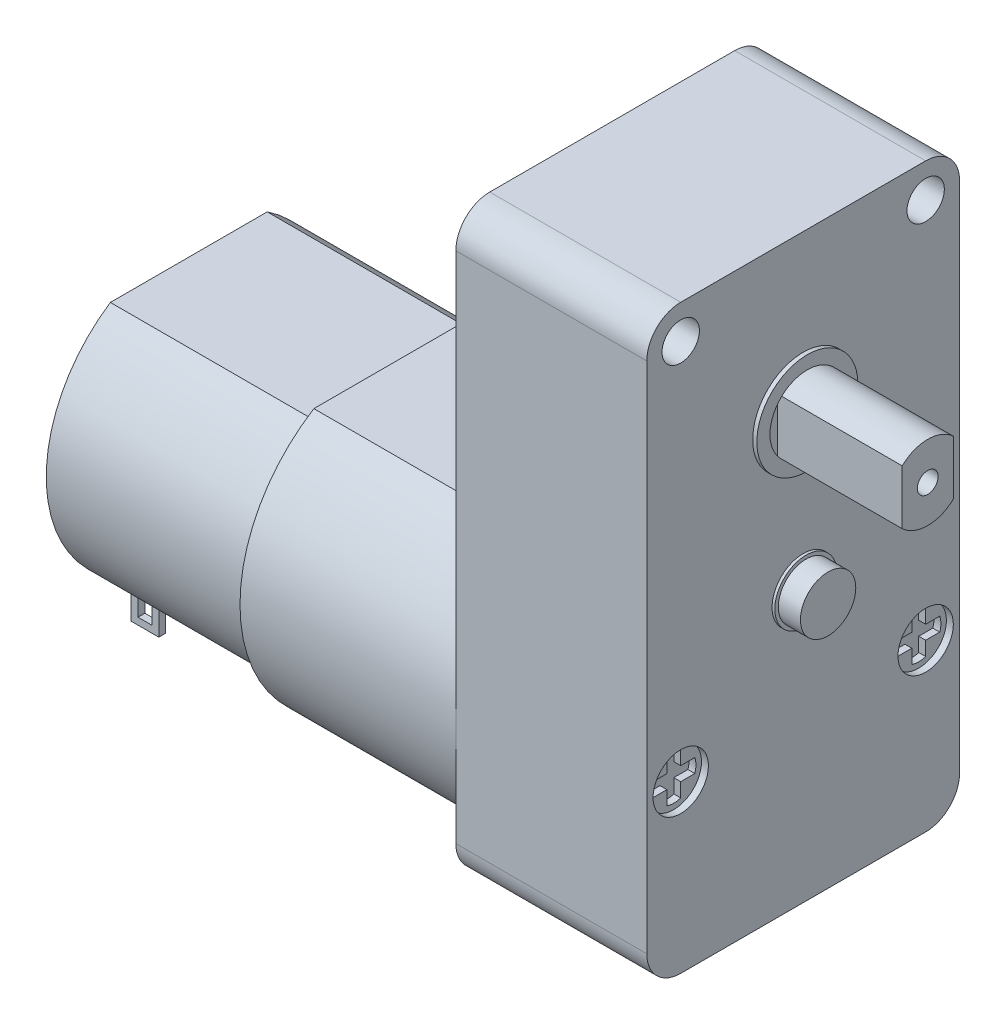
ISO-10303-21;
HEADER;
FILE_DESCRIPTION(('STEP AP214'),'2;1');
FILE_NAME('part.step','',(''),(''),'','','');
FILE_SCHEMA(('AUTOMOTIVE_DESIGN { 1 0 10303 214 1 1 1 1 }'));
ENDSEC;
DATA;
#1=APPLICATION_CONTEXT('core data for automotive mechanical design processes');
#2=APPLICATION_PROTOCOL_DEFINITION('international standard','automotive_design',2000,#1);
#3=PRODUCT_CONTEXT('',#1,'mechanical');
#4=PRODUCT('Part','Part','',(#3));
#5=PRODUCT_RELATED_PRODUCT_CATEGORY('part','',(#4));
#6=PRODUCT_DEFINITION_FORMATION('','',#4);
#7=PRODUCT_DEFINITION_CONTEXT('part definition',#1,'design');
#8=PRODUCT_DEFINITION('design','',#6,#7);
#9=PRODUCT_DEFINITION_SHAPE('','',#8);
#10=(LENGTH_UNIT() NAMED_UNIT(*) SI_UNIT(.MILLI.,.METRE.));
#11=(NAMED_UNIT(*) PLANE_ANGLE_UNIT() SI_UNIT($,.RADIAN.));
#12=(NAMED_UNIT(*) SI_UNIT($,.STERADIAN.) SOLID_ANGLE_UNIT());
#13=UNCERTAINTY_MEASURE_WITH_UNIT(LENGTH_MEASURE(1.E-05),#10,'distance_accuracy_value','');
#14=(GEOMETRIC_REPRESENTATION_CONTEXT(3) GLOBAL_UNCERTAINTY_ASSIGNED_CONTEXT((#13)) GLOBAL_UNIT_ASSIGNED_CONTEXT((#10,
#11,#12)) REPRESENTATION_CONTEXT('',''));
#15=CARTESIAN_POINT('',(0.,0.,0.));
#16=DIRECTION('',(0.,0.,1.));
#17=DIRECTION('',(1.,0.,0.));
#18=AXIS2_PLACEMENT_3D('',#15,#16,#17);
#19=CARTESIAN_POINT('',(-30.6,0.999999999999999,-16.9683330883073));
#20=DIRECTION('',(0.,1.,0.));
#21=DIRECTION('',(0.,0.,1.));
#22=AXIS2_PLACEMENT_3D('',#19,#20,#21);
#23=PLANE('',#22);
#24=DIRECTION('',(0.,0.,-1.));
#25=VECTOR('',#24,1.);
#26=CARTESIAN_POINT('',(-30.1,0.999999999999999,-6.63166691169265));
#27=LINE('',#26,#25);
#28=CARTESIAN_POINT('',(-30.1,0.999999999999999,-6.63166691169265));
#29=VERTEX_POINT('',#28);
#30=CARTESIAN_POINT('',(-30.1,0.999999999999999,-7.13166691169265));
#31=VERTEX_POINT('',#30);
#32=EDGE_CURVE('E523',#29,#31,#27,.T.);
#33=ORIENTED_EDGE('',*,*,#32,.F.);
#34=DIRECTION('',(-1.,0.,0.));
#35=VECTOR('',#34,1.);
#36=CARTESIAN_POINT('',(-30.1,0.999999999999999,-6.63166691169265));
#37=LINE('',#36,#35);
#38=CARTESIAN_POINT('',(-28.1,0.999999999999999,-6.63166691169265));
#39=VERTEX_POINT('',#38);
#40=EDGE_CURVE('E528',#39,#29,#37,.T.);
#41=ORIENTED_EDGE('',*,*,#40,.F.);
#42=DIRECTION('',(0.,0.,1.));
#43=VECTOR('',#42,1.);
#44=CARTESIAN_POINT('',(-28.1,0.999999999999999,-6.63166691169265));
#45=LINE('',#44,#43);
#46=CARTESIAN_POINT('',(-28.1,0.999999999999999,-7.13166691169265));
#47=VERTEX_POINT('',#46);
#48=EDGE_CURVE('E540',#47,#39,#45,.T.);
#49=ORIENTED_EDGE('',*,*,#48,.F.);
#50=DIRECTION('',(1.,0.,0.));
#51=VECTOR('',#50,1.);
#52=CARTESIAN_POINT('',(-30.1,0.999999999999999,-7.13166691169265));
#53=LINE('',#52,#51);
#54=EDGE_CURVE('E537',#31,#47,#53,.T.);
#55=ORIENTED_EDGE('',*,*,#54,.F.);
#56=EDGE_LOOP('',(#33,#41,#49,#55));
#57=FACE_BOUND('',#56,.T.);
#58=DIRECTION('',(0.,0.,1.));
#59=VECTOR('',#58,1.);
#60=CARTESIAN_POINT('',(-15.6,0.999999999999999,-16.9683330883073));
#61=LINE('',#60,#59);
#62=CARTESIAN_POINT('',(-15.6,0.999999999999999,-16.9683330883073));
#63=VERTEX_POINT('',#62);
#64=CARTESIAN_POINT('',(-15.6,0.999999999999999,-5.63166691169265));
#65=VERTEX_POINT('',#64);
#66=EDGE_CURVE('E573',#63,#65,#61,.T.);
#67=ORIENTED_EDGE('',*,*,#66,.T.);
#68=DIRECTION('',(1.,0.,0.));
#69=VECTOR('',#68,1.);
#70=CARTESIAN_POINT('',(-30.6,0.999999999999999,-5.63166691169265));
#71=LINE('',#70,#69);
#72=CARTESIAN_POINT('',(-30.6,0.999999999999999,-5.63166691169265));
#73=VERTEX_POINT('',#72);
#74=EDGE_CURVE('E579',#73,#65,#71,.T.);
#75=ORIENTED_EDGE('',*,*,#74,.F.);
#76=DIRECTION('',(0.,0.,1.));
#77=VECTOR('',#76,1.);
#78=CARTESIAN_POINT('',(-30.6,0.999999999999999,-16.9683330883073));
#79=LINE('',#78,#77);
#80=CARTESIAN_POINT('',(-30.6,0.999999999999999,-16.9683330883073));
#81=VERTEX_POINT('',#80);
#82=EDGE_CURVE('E577',#81,#73,#79,.T.);
#83=ORIENTED_EDGE('',*,*,#82,.F.);
#84=DIRECTION('',(1.,0.,0.));
#85=VECTOR('',#84,1.);
#86=CARTESIAN_POINT('',(-30.6,0.999999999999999,-16.9683330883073));
#87=LINE('',#86,#85);
#88=EDGE_CURVE('E590',#81,#63,#87,.T.);
#89=ORIENTED_EDGE('',*,*,#88,.T.);
#90=EDGE_LOOP('',(#67,#75,#83,#89));
#91=FACE_BOUND('',#90,.T.);
#92=DIRECTION('',(0.,0.,-1.));
#93=VECTOR('',#92,1.);
#94=CARTESIAN_POINT('',(-30.1,0.999999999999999,-15.9683330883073));
#95=LINE('',#94,#93);
#96=CARTESIAN_POINT('',(-30.1,0.999999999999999,-15.4683330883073));
#97=VERTEX_POINT('',#96);
#98=CARTESIAN_POINT('',(-30.1,0.999999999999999,-15.9683330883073));
#99=VERTEX_POINT('',#98);
#100=EDGE_CURVE('E490',#97,#99,#95,.T.);
#101=ORIENTED_EDGE('',*,*,#100,.F.);
#102=DIRECTION('',(-1.,0.,0.));
#103=VECTOR('',#102,1.);
#104=CARTESIAN_POINT('',(-30.1,0.999999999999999,-15.4683330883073));
#105=LINE('',#104,#103);
#106=CARTESIAN_POINT('',(-28.1,0.999999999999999,-15.4683330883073));
#107=VERTEX_POINT('',#106);
#108=EDGE_CURVE('E495',#107,#97,#105,.T.);
#109=ORIENTED_EDGE('',*,*,#108,.F.);
#110=DIRECTION('',(0.,0.,1.));
#111=VECTOR('',#110,1.);
#112=CARTESIAN_POINT('',(-28.1,0.999999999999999,-15.9683330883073));
#113=LINE('',#112,#111);
#114=CARTESIAN_POINT('',(-28.1,0.999999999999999,-15.9683330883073));
#115=VERTEX_POINT('',#114);
#116=EDGE_CURVE('E507',#115,#107,#113,.T.);
#117=ORIENTED_EDGE('',*,*,#116,.F.);
#118=DIRECTION('',(1.,0.,0.));
#119=VECTOR('',#118,1.);
#120=CARTESIAN_POINT('',(-30.1,0.999999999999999,-15.9683330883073));
#121=LINE('',#120,#119);
#122=EDGE_CURVE('E504',#99,#115,#121,.T.);
#123=ORIENTED_EDGE('',*,*,#122,.F.);
#124=EDGE_LOOP('',(#101,#109,#117,#123));
#125=FACE_BOUND('',#124,.T.);
#126=ADVANCED_FACE('F35',(#57,#91,#125),#23,.F.);
#127=CARTESIAN_POINT('',(-15.6,9.6,-11.3));
#128=DIRECTION('',(-1.,0.,0.));
#129=DIRECTION('',(0.,0.,1.));
#130=AXIS2_PLACEMENT_3D('',#127,#128,#129);
#131=PLANE('',#130);
#132=CARTESIAN_POINT('',(-15.6,9.6,-11.3));
#133=DIRECTION('',(-1.,0.,0.));
#134=DIRECTION('',(0.,0.,1.));
#135=AXIS2_PLACEMENT_3D('',#132,#133,#134);
#136=CIRCLE('',#135,11.3);
#137=CARTESIAN_POINT('',(-15.6,0.,-5.33929534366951));
#138=VERTEX_POINT('',#137);
#139=CARTESIAN_POINT('',(-15.6,19.2,-5.33929534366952));
#140=VERTEX_POINT('',#139);
#141=EDGE_CURVE('E598',#138,#140,#136,.T.);
#142=ORIENTED_EDGE('',*,*,#141,.T.);
#143=DIRECTION('',(0.,0.,-1.));
#144=VECTOR('',#143,1.);
#145=CARTESIAN_POINT('',(-15.6,19.2,-17.2607046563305));
#146=LINE('',#145,#144);
#147=CARTESIAN_POINT('',(-15.6,19.2,-17.2607046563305));
#148=VERTEX_POINT('',#147);
#149=EDGE_CURVE('E601',#140,#148,#146,.T.);
#150=ORIENTED_EDGE('',*,*,#149,.T.);
#151=CARTESIAN_POINT('',(-15.6,9.6,-11.3));
#152=DIRECTION('',(-1.,0.,0.));
#153=DIRECTION('',(0.,0.,1.));
#154=AXIS2_PLACEMENT_3D('',#151,#152,#153);
#155=CIRCLE('',#154,11.3);
#156=CARTESIAN_POINT('',(-15.6,0.,-17.2607046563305));
#157=VERTEX_POINT('',#156);
#158=EDGE_CURVE('E604',#148,#157,#155,.T.);
#159=ORIENTED_EDGE('',*,*,#158,.T.);
#160=DIRECTION('',(0.,0.,1.));
#161=VECTOR('',#160,1.);
#162=CARTESIAN_POINT('',(-15.6,0.,-17.2607046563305));
#163=LINE('',#162,#161);
#164=EDGE_CURVE('E606',#157,#138,#163,.T.);
#165=ORIENTED_EDGE('',*,*,#164,.T.);
#166=EDGE_LOOP('',(#142,#150,#159,#165));
#167=FACE_BOUND('',#166,.T.);
#168=DIRECTION('',(0.,0.,-1.));
#169=VECTOR('',#168,1.);
#170=CARTESIAN_POINT('',(-15.6,18.2,-5.63166691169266));
#171=LINE('',#170,#169);
#172=CARTESIAN_POINT('',(-15.6,18.2,-5.63166691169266));
#173=VERTEX_POINT('',#172);
#174=CARTESIAN_POINT('',(-15.6,18.2,-16.9683330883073));
#175=VERTEX_POINT('',#174);
#176=EDGE_CURVE('E582',#173,#175,#171,.T.);
#177=ORIENTED_EDGE('',*,*,#176,.F.);
#178=CARTESIAN_POINT('',(-15.6,9.6,-11.3));
#179=DIRECTION('',(-1.,0.,0.));
#180=DIRECTION('',(0.,0.,1.));
#181=AXIS2_PLACEMENT_3D('',#178,#179,#180);
#182=CIRCLE('',#181,10.3);
#183=EDGE_CURVE('E566',#65,#173,#182,.T.);
#184=ORIENTED_EDGE('',*,*,#183,.F.);
#185=ORIENTED_EDGE('',*,*,#66,.F.);
#186=CARTESIAN_POINT('',(-15.6,9.6,-11.3));
#187=DIRECTION('',(-1.,0.,0.));
#188=DIRECTION('',(0.,0.,1.));
#189=AXIS2_PLACEMENT_3D('',#186,#187,#188);
#190=CIRCLE('',#189,10.3);
#191=EDGE_CURVE('E584',#175,#63,#190,.T.);
#192=ORIENTED_EDGE('',*,*,#191,.F.);
#193=EDGE_LOOP('',(#177,#184,#185,#192));
#194=FACE_BOUND('',#193,.T.);
#195=ADVANCED_FACE('F656',(#167,#194),#131,.T.);
#196=CARTESIAN_POINT('',(0.,2.45,-2.45));
#197=DIRECTION('',(1.,0.,0.));
#198=DIRECTION('',(0.,0.,-1.));
#199=AXIS2_PLACEMENT_3D('',#196,#197,#198);
#200=PLANE('',#199);
#201=CARTESIAN_POINT('',(0.,9.6,-11.3));
#202=DIRECTION('',(-1.,0.,0.));
#203=DIRECTION('',(0.,0.,1.));
#204=AXIS2_PLACEMENT_3D('',#201,#202,#203);
#205=CIRCLE('',#204,11.3);
#206=CARTESIAN_POINT('',(0.,9.6,-22.6));
#207=VERTEX_POINT('',#206);
#208=CARTESIAN_POINT('',(0.,0.,-17.2607046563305));
#209=VERTEX_POINT('',#208);
#210=EDGE_CURVE('E613',#207,#209,#205,.T.);
#211=ORIENTED_EDGE('',*,*,#210,.F.);
#212=DIRECTION('',(0.,1.,0.));
#213=VECTOR('',#212,1.);
#214=CARTESIAN_POINT('',(0.,2.45,-22.6));
#215=LINE('',#214,#213);
#216=CARTESIAN_POINT('',(0.,2.45,-22.6));
#217=VERTEX_POINT('',#216);
#218=EDGE_CURVE('E948',#217,#207,#215,.T.);
#219=ORIENTED_EDGE('',*,*,#218,.F.);
#220=CARTESIAN_POINT('',(0.,2.45,-20.15));
#221=DIRECTION('',(1.,0.,0.));
#222=DIRECTION('',(0.,0.,-1.));
#223=AXIS2_PLACEMENT_3D('',#220,#221,#222);
#224=CIRCLE('',#223,2.45);
#225=CARTESIAN_POINT('',(0.,0.,-20.15));
#226=VERTEX_POINT('',#225);
#227=EDGE_CURVE('E929',#226,#217,#224,.T.);
#228=ORIENTED_EDGE('',*,*,#227,.F.);
#229=DIRECTION('',(0.,0.,-1.));
#230=VECTOR('',#229,1.);
#231=CARTESIAN_POINT('',(0.,0.,-2.45));
#232=LINE('',#231,#230);
#233=EDGE_CURVE('E930',#209,#226,#232,.T.);
#234=ORIENTED_EDGE('',*,*,#233,.F.);
#235=EDGE_LOOP('',(#211,#219,#228,#234));
#236=FACE_BOUND('',#235,.T.);
#237=ADVANCED_FACE('F663',(#236),#200,.F.);
#238=CARTESIAN_POINT('',(0.,9.6,-11.3));
#239=DIRECTION('',(-1.,0.,0.));
#240=DIRECTION('',(0.,0.,1.));
#241=AXIS2_PLACEMENT_3D('',#238,#239,#240);
#242=CIRCLE('',#241,11.3);
#243=CARTESIAN_POINT('',(0.,0.,-5.33929534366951));
#244=VERTEX_POINT('',#243);
#245=CARTESIAN_POINT('',(0.,9.6,0.));
#246=VERTEX_POINT('',#245);
#247=EDGE_CURVE('E597',#244,#246,#242,.T.);
#248=ORIENTED_EDGE('',*,*,#247,.F.);
#249=CARTESIAN_POINT('',(0.,0.,-2.45));
#250=VERTEX_POINT('',#249);
#251=EDGE_CURVE('E921',#250,#244,#232,.T.);
#252=ORIENTED_EDGE('',*,*,#251,.F.);
#253=CARTESIAN_POINT('',(0.,2.45,-2.45));
#254=DIRECTION('',(1.,0.,0.));
#255=DIRECTION('',(0.,0.,-1.));
#256=AXIS2_PLACEMENT_3D('',#253,#254,#255);
#257=CIRCLE('',#256,2.45);
#258=CARTESIAN_POINT('',(0.,2.45,0.));
#259=VERTEX_POINT('',#258);
#260=EDGE_CURVE('E1005',#259,#250,#257,.T.);
#261=ORIENTED_EDGE('',*,*,#260,.F.);
#262=DIRECTION('',(0.,-1.,0.));
#263=VECTOR('',#262,1.);
#264=CARTESIAN_POINT('',(0.,2.45,0.));
#265=LINE('',#264,#263);
#266=EDGE_CURVE('E970',#246,#259,#265,.T.);
#267=ORIENTED_EDGE('',*,*,#266,.F.);
#268=EDGE_LOOP('',(#248,#252,#261,#267));
#269=FACE_BOUND('',#268,.T.);
#270=ADVANCED_FACE('F886',(#269),#200,.F.);
#271=CARTESIAN_POINT('',(0.,39.55,-2.44999999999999));
#272=DIRECTION('',(1.,0.,0.));
#273=DIRECTION('',(0.,0.,-1.));
#274=AXIS2_PLACEMENT_3D('',#271,#272,#273);
#275=CIRCLE('',#274,1.35);
#276=CARTESIAN_POINT('',(0.,39.55,-3.79999999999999));
#277=VERTEX_POINT('',#276);
#278=EDGE_CURVE('E1008',#277,#277,#275,.T.);
#279=ORIENTED_EDGE('',*,*,#278,.T.);
#280=EDGE_LOOP('',(#279));
#281=FACE_BOUND('',#280,.T.);
#282=CARTESIAN_POINT('',(0.,39.55,-20.15));
#283=DIRECTION('',(1.,0.,0.));
#284=DIRECTION('',(0.,0.,-1.));
#285=AXIS2_PLACEMENT_3D('',#282,#283,#284);
#286=CIRCLE('',#285,1.35);
#287=CARTESIAN_POINT('',(0.,39.55,-21.5));
#288=VERTEX_POINT('',#287);
#289=EDGE_CURVE('E1027',#288,#288,#286,.T.);
#290=ORIENTED_EDGE('',*,*,#289,.T.);
#291=EDGE_LOOP('',(#290));
#292=FACE_BOUND('',#291,.T.);
#293=CARTESIAN_POINT('',(0.,19.2,-5.33929534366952));
#294=VERTEX_POINT('',#293);
#295=EDGE_CURVE('E609',#246,#294,#242,.T.);
#296=ORIENTED_EDGE('',*,*,#295,.F.);
#297=CARTESIAN_POINT('',(0.,39.55,0.));
#298=VERTEX_POINT('',#297);
#299=EDGE_CURVE('E971',#298,#246,#265,.T.);
#300=ORIENTED_EDGE('',*,*,#299,.F.);
#301=CARTESIAN_POINT('',(0.,39.55,-2.45));
#302=DIRECTION('',(1.,0.,0.));
#303=DIRECTION('',(0.,0.,1.));
#304=AXIS2_PLACEMENT_3D('',#301,#302,#303);
#305=CIRCLE('',#304,2.45);
#306=CARTESIAN_POINT('',(0.,42.,-2.45));
#307=VERTEX_POINT('',#306);
#308=EDGE_CURVE('E968',#307,#298,#305,.T.);
#309=ORIENTED_EDGE('',*,*,#308,.F.);
#310=DIRECTION('',(0.,0.,1.));
#311=VECTOR('',#310,1.);
#312=CARTESIAN_POINT('',(0.,42.,-2.45));
#313=LINE('',#312,#311);
#314=CARTESIAN_POINT('',(0.,42.,-20.15));
#315=VERTEX_POINT('',#314);
#316=EDGE_CURVE('E962',#315,#307,#313,.T.);
#317=ORIENTED_EDGE('',*,*,#316,.F.);
#318=CARTESIAN_POINT('',(0.,39.55,-20.15));
#319=DIRECTION('',(1.,0.,0.));
#320=DIRECTION('',(0.,0.,-1.));
#321=AXIS2_PLACEMENT_3D('',#318,#319,#320);
#322=CIRCLE('',#321,2.45);
#323=CARTESIAN_POINT('',(0.,39.55,-22.6));
#324=VERTEX_POINT('',#323);
#325=EDGE_CURVE('E954',#324,#315,#322,.T.);
#326=ORIENTED_EDGE('',*,*,#325,.F.);
#327=EDGE_CURVE('E951',#207,#324,#215,.T.);
#328=ORIENTED_EDGE('',*,*,#327,.F.);
#329=CARTESIAN_POINT('',(0.,19.2,-17.2607046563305));
#330=VERTEX_POINT('',#329);
#331=EDGE_CURVE('E602',#330,#207,#205,.T.);
#332=ORIENTED_EDGE('',*,*,#331,.F.);
#333=DIRECTION('',(0.,0.,-1.));
#334=VECTOR('',#333,1.);
#335=CARTESIAN_POINT('',(0.,19.2,-17.2607046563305));
#336=LINE('',#335,#334);
#337=EDGE_CURVE('E615',#294,#330,#336,.T.);
#338=ORIENTED_EDGE('',*,*,#337,.F.);
#339=EDGE_LOOP('',(#296,#300,#309,#317,#326,#328,#332,#338));
#340=FACE_BOUND('',#339,.T.);
#341=ADVANCED_FACE('F888',(#281,#292,#340),#200,.F.);
#342=CARTESIAN_POINT('',(13.8,2.45,-2.45));
#343=DIRECTION('',(-1.,0.,0.));
#344=DIRECTION('',(0.,0.,1.));
#345=AXIS2_PLACEMENT_3D('',#342,#343,#344);
#346=CYLINDRICAL_SURFACE('',#345,2.45);
#347=ORIENTED_EDGE('',*,*,#260,.T.);
#348=DIRECTION('',(-1.,0.,0.));
#349=VECTOR('',#348,1.);
#350=CARTESIAN_POINT('',(13.8,0.,-2.45));
#351=LINE('',#350,#349);
#352=CARTESIAN_POINT('',(13.8,0.,-2.45));
#353=VERTEX_POINT('',#352);
#354=EDGE_CURVE('E925',#353,#250,#351,.T.);
#355=ORIENTED_EDGE('',*,*,#354,.F.);
#356=CARTESIAN_POINT('',(13.8,2.45,-2.45));
#357=DIRECTION('',(1.,0.,0.));
#358=DIRECTION('',(0.,0.,-1.));
#359=AXIS2_PLACEMENT_3D('',#356,#357,#358);
#360=CIRCLE('',#359,2.45);
#361=CARTESIAN_POINT('',(13.8,2.45,0.));
#362=VERTEX_POINT('',#361);
#363=EDGE_CURVE('E974',#362,#353,#360,.T.);
#364=ORIENTED_EDGE('',*,*,#363,.F.);
#365=DIRECTION('',(-1.,0.,0.));
#366=VECTOR('',#365,1.);
#367=CARTESIAN_POINT('',(13.8,2.45,0.));
#368=LINE('',#367,#366);
#369=EDGE_CURVE('E975',#362,#259,#368,.T.);
#370=ORIENTED_EDGE('',*,*,#369,.T.);
#371=EDGE_LOOP('',(#347,#355,#364,#370));
#372=FACE_BOUND('',#371,.T.);
#373=ADVANCED_FACE('F37',(#372),#346,.T.);
#374=CARTESIAN_POINT('',(13.8,0.,-2.45));
#375=DIRECTION('',(0.,1.,0.));
#376=DIRECTION('',(0.,0.,1.));
#377=AXIS2_PLACEMENT_3D('',#374,#375,#376);
#378=PLANE('',#377);
#379=ORIENTED_EDGE('',*,*,#251,.T.);
#380=DIRECTION('',(1.,0.,0.));
#381=VECTOR('',#380,1.);
#382=CARTESIAN_POINT('',(-15.6,0.,-5.33929534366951));
#383=LINE('',#382,#381);
#384=EDGE_CURVE('E608',#138,#244,#383,.T.);
#385=ORIENTED_EDGE('',*,*,#384,.F.);
#386=ORIENTED_EDGE('',*,*,#164,.F.);
#387=DIRECTION('',(1.,0.,0.));
#388=VECTOR('',#387,1.);
#389=CARTESIAN_POINT('',(-15.6,0.,-17.2607046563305));
#390=LINE('',#389,#388);
#391=EDGE_CURVE('E624',#157,#209,#390,.T.);
#392=ORIENTED_EDGE('',*,*,#391,.T.);
#393=ORIENTED_EDGE('',*,*,#233,.T.);
#394=DIRECTION('',(-1.,0.,0.));
#395=VECTOR('',#394,1.);
#396=CARTESIAN_POINT('',(13.8,0.,-20.15));
#397=LINE('',#396,#395);
#398=CARTESIAN_POINT('',(13.8,0.,-20.15));
#399=VERTEX_POINT('',#398);
#400=EDGE_CURVE('E991',#399,#226,#397,.T.);
#401=ORIENTED_EDGE('',*,*,#400,.F.);
#402=DIRECTION('',(0.,0.,-1.));
#403=VECTOR('',#402,1.);
#404=CARTESIAN_POINT('',(13.8,0.,-2.45));
#405=LINE('',#404,#403);
#406=EDGE_CURVE('E1020',#353,#399,#405,.T.);
#407=ORIENTED_EDGE('',*,*,#406,.F.);
#408=ORIENTED_EDGE('',*,*,#354,.T.);
#409=EDGE_LOOP('',(#379,#385,#386,#392,#393,#401,#407,#408));
#410=FACE_BOUND('',#409,.T.);
#411=ADVANCED_FACE('F910',(#410),#378,.F.);
#412=CARTESIAN_POINT('',(13.8,2.45,-20.15));
#413=DIRECTION('',(-1.,0.,0.));
#414=DIRECTION('',(0.,0.,1.));
#415=AXIS2_PLACEMENT_3D('',#412,#413,#414);
#416=CYLINDRICAL_SURFACE('',#415,2.45);
#417=ORIENTED_EDGE('',*,*,#227,.T.);
#418=DIRECTION('',(-1.,0.,0.));
#419=VECTOR('',#418,1.);
#420=CARTESIAN_POINT('',(13.8,2.45,-22.6));
#421=LINE('',#420,#419);
#422=CARTESIAN_POINT('',(13.8,2.45,-22.6));
#423=VERTEX_POINT('',#422);
#424=EDGE_CURVE('E961',#423,#217,#421,.T.);
#425=ORIENTED_EDGE('',*,*,#424,.F.);
#426=CARTESIAN_POINT('',(13.8,2.45,-20.15));
#427=DIRECTION('',(1.,0.,0.));
#428=DIRECTION('',(0.,0.,-1.));
#429=AXIS2_PLACEMENT_3D('',#426,#427,#428);
#430=CIRCLE('',#429,2.45);
#431=EDGE_CURVE('E1018',#399,#423,#430,.T.);
#432=ORIENTED_EDGE('',*,*,#431,.F.);
#433=ORIENTED_EDGE('',*,*,#400,.T.);
#434=EDGE_LOOP('',(#417,#425,#432,#433));
#435=FACE_BOUND('',#434,.T.);
#436=ADVANCED_FACE('F907',(#435),#416,.T.);
#437=CARTESIAN_POINT('',(13.8,2.45,-22.6));
#438=DIRECTION('',(0.,0.,1.));
#439=DIRECTION('',(0.,-1.,0.));
#440=AXIS2_PLACEMENT_3D('',#437,#438,#439);
#441=PLANE('',#440);
#442=ORIENTED_EDGE('',*,*,#218,.T.);
#443=ORIENTED_EDGE('',*,*,#327,.T.);
#444=DIRECTION('',(-1.,0.,0.));
#445=VECTOR('',#444,1.);
#446=CARTESIAN_POINT('',(13.8,39.55,-22.6));
#447=LINE('',#446,#445);
#448=CARTESIAN_POINT('',(13.8,39.55,-22.6));
#449=VERTEX_POINT('',#448);
#450=EDGE_CURVE('E988',#449,#324,#447,.T.);
#451=ORIENTED_EDGE('',*,*,#450,.F.);
#452=DIRECTION('',(0.,1.,0.));
#453=VECTOR('',#452,1.);
#454=CARTESIAN_POINT('',(13.8,2.45,-22.6));
#455=LINE('',#454,#453);
#456=EDGE_CURVE('E1016',#423,#449,#455,.T.);
#457=ORIENTED_EDGE('',*,*,#456,.F.);
#458=ORIENTED_EDGE('',*,*,#424,.T.);
#459=EDGE_LOOP('',(#442,#443,#451,#457,#458));
#460=FACE_BOUND('',#459,.T.);
#461=ADVANCED_FACE('F903',(#460),#441,.F.);
#462=CARTESIAN_POINT('',(13.8,39.55,-20.15));
#463=DIRECTION('',(-1.,0.,0.));
#464=DIRECTION('',(0.,0.,1.));
#465=AXIS2_PLACEMENT_3D('',#462,#463,#464);
#466=CYLINDRICAL_SURFACE('',#465,2.45);
#467=ORIENTED_EDGE('',*,*,#325,.T.);
#468=DIRECTION('',(-1.,0.,0.));
#469=VECTOR('',#468,1.);
#470=CARTESIAN_POINT('',(13.8,42.,-20.15));
#471=LINE('',#470,#469);
#472=CARTESIAN_POINT('',(13.8,42.,-20.15));
#473=VERTEX_POINT('',#472);
#474=EDGE_CURVE('E985',#473,#315,#471,.T.);
#475=ORIENTED_EDGE('',*,*,#474,.F.);
#476=CARTESIAN_POINT('',(13.8,39.55,-20.15));
#477=DIRECTION('',(1.,0.,0.));
#478=DIRECTION('',(0.,0.,-1.));
#479=AXIS2_PLACEMENT_3D('',#476,#477,#478);
#480=CIRCLE('',#479,2.45);
#481=EDGE_CURVE('E1014',#449,#473,#480,.T.);
#482=ORIENTED_EDGE('',*,*,#481,.F.);
#483=ORIENTED_EDGE('',*,*,#450,.T.);
#484=EDGE_LOOP('',(#467,#475,#482,#483));
#485=FACE_BOUND('',#484,.T.);
#486=ADVANCED_FACE('F899',(#485),#466,.T.);
#487=CARTESIAN_POINT('',(13.8,42.,-2.45));
#488=DIRECTION('',(0.,-1.,0.));
#489=DIRECTION('',(0.,0.,-1.));
#490=AXIS2_PLACEMENT_3D('',#487,#488,#489);
#491=PLANE('',#490);
#492=ORIENTED_EDGE('',*,*,#316,.T.);
#493=DIRECTION('',(-1.,0.,0.));
#494=VECTOR('',#493,1.);
#495=CARTESIAN_POINT('',(13.8,42.,-2.45));
#496=LINE('',#495,#494);
#497=CARTESIAN_POINT('',(13.8,42.,-2.45));
#498=VERTEX_POINT('',#497);
#499=EDGE_CURVE('E982',#498,#307,#496,.T.);
#500=ORIENTED_EDGE('',*,*,#499,.F.);
#501=DIRECTION('',(0.,0.,1.));
#502=VECTOR('',#501,1.);
#503=CARTESIAN_POINT('',(13.8,42.,-2.45));
#504=LINE('',#503,#502);
#505=EDGE_CURVE('E1012',#473,#498,#504,.T.);
#506=ORIENTED_EDGE('',*,*,#505,.F.);
#507=ORIENTED_EDGE('',*,*,#474,.T.);
#508=EDGE_LOOP('',(#492,#500,#506,#507));
#509=FACE_BOUND('',#508,.T.);
#510=ADVANCED_FACE('F895',(#509),#491,.F.);
#511=CARTESIAN_POINT('',(13.8,39.55,-2.45));
#512=DIRECTION('',(-1.,0.,0.));
#513=DIRECTION('',(0.,0.,1.));
#514=AXIS2_PLACEMENT_3D('',#511,#512,#513);
#515=CYLINDRICAL_SURFACE('',#514,2.45);
#516=ORIENTED_EDGE('',*,*,#308,.T.);
#517=DIRECTION('',(-1.,0.,0.));
#518=VECTOR('',#517,1.);
#519=CARTESIAN_POINT('',(13.8,39.55,0.));
#520=LINE('',#519,#518);
#521=CARTESIAN_POINT('',(13.8,39.55,0.));
#522=VERTEX_POINT('',#521);
#523=EDGE_CURVE('E978',#522,#298,#520,.T.);
#524=ORIENTED_EDGE('',*,*,#523,.F.);
#525=CARTESIAN_POINT('',(13.8,39.55,-2.45));
#526=DIRECTION('',(1.,0.,0.));
#527=DIRECTION('',(0.,0.,1.));
#528=AXIS2_PLACEMENT_3D('',#525,#526,#527);
#529=CIRCLE('',#528,2.45);
#530=EDGE_CURVE('E1010',#498,#522,#529,.T.);
#531=ORIENTED_EDGE('',*,*,#530,.F.);
#532=ORIENTED_EDGE('',*,*,#499,.T.);
#533=EDGE_LOOP('',(#516,#524,#531,#532));
#534=FACE_BOUND('',#533,.T.);
#535=ADVANCED_FACE('F891',(#534),#515,.T.);
#536=CARTESIAN_POINT('',(13.8,2.45,0.));
#537=DIRECTION('',(0.,0.,-1.));
#538=DIRECTION('',(0.,1.,0.));
#539=AXIS2_PLACEMENT_3D('',#536,#537,#538);
#540=PLANE('',#539);
#541=ORIENTED_EDGE('',*,*,#299,.T.);
#542=ORIENTED_EDGE('',*,*,#266,.T.);
#543=ORIENTED_EDGE('',*,*,#369,.F.);
#544=DIRECTION('',(0.,-1.,0.));
#545=VECTOR('',#544,1.);
#546=CARTESIAN_POINT('',(13.8,2.45,0.));
#547=LINE('',#546,#545);
#548=EDGE_CURVE('E979',#522,#362,#547,.T.);
#549=ORIENTED_EDGE('',*,*,#548,.F.);
#550=ORIENTED_EDGE('',*,*,#523,.T.);
#551=EDGE_LOOP('',(#541,#542,#543,#549,#550));
#552=FACE_BOUND('',#551,.T.);
#553=ADVANCED_FACE('F881',(#552),#540,.F.);
#554=CARTESIAN_POINT('',(13.8,2.45,-2.45));
#555=DIRECTION('',(1.,0.,0.));
#556=DIRECTION('',(0.,0.,-1.));
#557=AXIS2_PLACEMENT_3D('',#554,#555,#556);
#558=PLANE('',#557);
#559=CARTESIAN_POINT('',(13.8,12.,-20.15));
#560=DIRECTION('',(1.,0.,0.));
#561=DIRECTION('',(0.,0.,-1.));
#562=AXIS2_PLACEMENT_3D('',#559,#560,#561);
#563=CIRCLE('',#562,2.);
#564=CARTESIAN_POINT('',(13.8,12.,-22.15));
#565=VERTEX_POINT('',#564);
#566=EDGE_CURVE('E1095',#565,#565,#563,.T.);
#567=ORIENTED_EDGE('',*,*,#566,.F.);
#568=EDGE_LOOP('',(#567));
#569=FACE_BOUND('',#568,.T.);
#570=CARTESIAN_POINT('',(13.8,12.,-2.45));
#571=DIRECTION('',(1.,0.,0.));
#572=DIRECTION('',(0.,0.,-1.));
#573=AXIS2_PLACEMENT_3D('',#570,#571,#572);
#574=CIRCLE('',#573,2.);
#575=CARTESIAN_POINT('',(13.8,12.,-4.45));
#576=VERTEX_POINT('',#575);
#577=EDGE_CURVE('E1089',#576,#576,#574,.T.);
#578=ORIENTED_EDGE('',*,*,#577,.F.);
#579=EDGE_LOOP('',(#578));
#580=FACE_BOUND('',#579,.T.);
#581=CARTESIAN_POINT('',(13.8,30.8,-11.3));
#582=DIRECTION('',(1.,0.,0.));
#583=DIRECTION('',(0.,0.,-1.));
#584=AXIS2_PLACEMENT_3D('',#581,#582,#583);
#585=CIRCLE('',#584,3.65);
#586=CARTESIAN_POINT('',(13.8,30.8,-14.95));
#587=VERTEX_POINT('',#586);
#588=EDGE_CURVE('E1076',#587,#587,#585,.T.);
#589=ORIENTED_EDGE('',*,*,#588,.F.);
#590=EDGE_LOOP('',(#589));
#591=FACE_BOUND('',#590,.T.);
#592=CARTESIAN_POINT('',(13.8,19.6,-11.3));
#593=DIRECTION('',(1.,0.,0.));
#594=DIRECTION('',(0.,0.,-1.));
#595=AXIS2_PLACEMENT_3D('',#592,#593,#594);
#596=CIRCLE('',#595,2.25);
#597=CARTESIAN_POINT('',(13.8,19.6,-13.55));
#598=VERTEX_POINT('',#597);
#599=EDGE_CURVE('E1037',#598,#598,#596,.T.);
#600=ORIENTED_EDGE('',*,*,#599,.F.);
#601=EDGE_LOOP('',(#600));
#602=FACE_BOUND('',#601,.T.);
#603=CARTESIAN_POINT('',(13.8,39.55,-20.15));
#604=DIRECTION('',(1.,0.,0.));
#605=DIRECTION('',(0.,0.,-1.));
#606=AXIS2_PLACEMENT_3D('',#603,#604,#605);
#607=CIRCLE('',#606,1.35);
#608=CARTESIAN_POINT('',(13.8,39.55,-21.5));
#609=VERTEX_POINT('',#608);
#610=EDGE_CURVE('E1030',#609,#609,#607,.T.);
#611=ORIENTED_EDGE('',*,*,#610,.F.);
#612=EDGE_LOOP('',(#611));
#613=FACE_BOUND('',#612,.T.);
#614=CARTESIAN_POINT('',(13.8,39.55,-2.44999999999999));
#615=DIRECTION('',(1.,0.,0.));
#616=DIRECTION('',(0.,0.,-1.));
#617=AXIS2_PLACEMENT_3D('',#614,#615,#616);
#618=CIRCLE('',#617,1.35);
#619=CARTESIAN_POINT('',(13.8,39.55,-3.79999999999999));
#620=VERTEX_POINT('',#619);
#621=EDGE_CURVE('E1024',#620,#620,#618,.T.);
#622=ORIENTED_EDGE('',*,*,#621,.F.);
#623=EDGE_LOOP('',(#622));
#624=FACE_BOUND('',#623,.T.);
#625=ORIENTED_EDGE('',*,*,#363,.T.);
#626=ORIENTED_EDGE('',*,*,#406,.T.);
#627=ORIENTED_EDGE('',*,*,#431,.T.);
#628=ORIENTED_EDGE('',*,*,#456,.T.);
#629=ORIENTED_EDGE('',*,*,#481,.T.);
#630=ORIENTED_EDGE('',*,*,#505,.T.);
#631=ORIENTED_EDGE('',*,*,#530,.T.);
#632=ORIENTED_EDGE('',*,*,#548,.T.);
#633=EDGE_LOOP('',(#625,#626,#627,#628,#629,#630,#631,#632));
#634=FACE_BOUND('',#633,.T.);
#635=ADVANCED_FACE('F877',(#569,#580,#591,#602,#613,#624,#634),#558,.T.);
#636=CARTESIAN_POINT('',(0.,39.55,-2.44999999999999));
#637=DIRECTION('',(1.,0.,0.));
#638=DIRECTION('',(0.,0.,-1.));
#639=AXIS2_PLACEMENT_3D('',#636,#637,#638);
#640=CYLINDRICAL_SURFACE('',#639,1.35);
#641=CARTESIAN_POINT('',(0.,39.55,-3.79999999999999));
#642=CARTESIAN_POINT('',(0.14375,39.55,-3.79999999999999));
#643=CARTESIAN_POINT('',(0.2875,39.55,-3.79999999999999));
#644=CARTESIAN_POINT('',(0.575,39.55,-3.79999999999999));
#645=CARTESIAN_POINT('',(0.71875,39.55,-3.79999999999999));
#646=CARTESIAN_POINT('',(1.00625,39.55,-3.79999999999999));
#647=CARTESIAN_POINT('',(1.15,39.55,-3.79999999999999));
#648=CARTESIAN_POINT('',(1.4375,39.55,-3.79999999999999));
#649=CARTESIAN_POINT('',(1.58125,39.55,-3.79999999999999));
#650=CARTESIAN_POINT('',(1.86875,39.55,-3.79999999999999));
#651=CARTESIAN_POINT('',(2.0125,39.55,-3.79999999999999));
#652=CARTESIAN_POINT('',(2.3,39.55,-3.79999999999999));
#653=CARTESIAN_POINT('',(2.44375,39.55,-3.79999999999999));
#654=CARTESIAN_POINT('',(2.73125,39.55,-3.79999999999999));
#655=CARTESIAN_POINT('',(2.875,39.55,-3.79999999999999));
#656=CARTESIAN_POINT('',(3.1625,39.55,-3.79999999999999));
#657=CARTESIAN_POINT('',(3.30625,39.55,-3.79999999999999));
#658=CARTESIAN_POINT('',(3.59375,39.55,-3.79999999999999));
#659=CARTESIAN_POINT('',(3.7375,39.55,-3.79999999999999));
#660=CARTESIAN_POINT('',(4.025,39.55,-3.79999999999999));
#661=CARTESIAN_POINT('',(4.16875,39.55,-3.79999999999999));
#662=CARTESIAN_POINT('',(4.45625,39.55,-3.79999999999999));
#663=CARTESIAN_POINT('',(4.6,39.55,-3.79999999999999));
#664=CARTESIAN_POINT('',(4.8875,39.55,-3.79999999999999));
#665=CARTESIAN_POINT('',(5.03125,39.55,-3.79999999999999));
#666=CARTESIAN_POINT('',(5.31875,39.55,-3.79999999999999));
#667=CARTESIAN_POINT('',(5.4625,39.55,-3.79999999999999));
#668=CARTESIAN_POINT('',(5.75,39.55,-3.79999999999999));
#669=CARTESIAN_POINT('',(5.89375,39.55,-3.79999999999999));
#670=CARTESIAN_POINT('',(6.18125,39.55,-3.79999999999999));
#671=CARTESIAN_POINT('',(6.325,39.55,-3.79999999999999));
#672=CARTESIAN_POINT('',(6.6125,39.55,-3.79999999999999));
#673=CARTESIAN_POINT('',(6.75625,39.55,-3.79999999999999));
#674=CARTESIAN_POINT('',(7.04375,39.55,-3.79999999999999));
#675=CARTESIAN_POINT('',(7.1875,39.55,-3.79999999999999));
#676=CARTESIAN_POINT('',(7.475,39.55,-3.79999999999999));
#677=CARTESIAN_POINT('',(7.61875,39.55,-3.79999999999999));
#678=CARTESIAN_POINT('',(7.90625,39.55,-3.79999999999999));
#679=CARTESIAN_POINT('',(8.05,39.55,-3.79999999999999));
#680=CARTESIAN_POINT('',(8.3375,39.55,-3.79999999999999));
#681=CARTESIAN_POINT('',(8.48125,39.55,-3.79999999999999));
#682=CARTESIAN_POINT('',(8.76875,39.55,-3.79999999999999));
#683=CARTESIAN_POINT('',(8.9125,39.55,-3.79999999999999));
#684=CARTESIAN_POINT('',(9.2,39.55,-3.79999999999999));
#685=CARTESIAN_POINT('',(9.34375,39.55,-3.79999999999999));
#686=CARTESIAN_POINT('',(9.63125,39.55,-3.79999999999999));
#687=CARTESIAN_POINT('',(9.775,39.55,-3.79999999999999));
#688=CARTESIAN_POINT('',(10.0625,39.55,-3.79999999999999));
#689=CARTESIAN_POINT('',(10.20625,39.55,-3.79999999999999));
#690=CARTESIAN_POINT('',(10.49375,39.55,-3.79999999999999));
#691=CARTESIAN_POINT('',(10.6375,39.55,-3.79999999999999));
#692=CARTESIAN_POINT('',(10.925,39.55,-3.79999999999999));
#693=CARTESIAN_POINT('',(11.06875,39.55,-3.79999999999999));
#694=CARTESIAN_POINT('',(11.35625,39.55,-3.79999999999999));
#695=CARTESIAN_POINT('',(11.5,39.55,-3.79999999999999));
#696=CARTESIAN_POINT('',(11.7875,39.55,-3.79999999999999));
#697=CARTESIAN_POINT('',(11.93125,39.55,-3.79999999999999));
#698=CARTESIAN_POINT('',(12.21875,39.55,-3.79999999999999));
#699=CARTESIAN_POINT('',(12.3625,39.55,-3.79999999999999));
#700=CARTESIAN_POINT('',(12.65,39.55,-3.79999999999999));
#701=CARTESIAN_POINT('',(12.79375,39.55,-3.79999999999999));
#702=CARTESIAN_POINT('',(13.08125,39.55,-3.79999999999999));
#703=CARTESIAN_POINT('',(13.225,39.55,-3.79999999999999));
#704=CARTESIAN_POINT('',(13.5125,39.55,-3.79999999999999));
#705=CARTESIAN_POINT('',(13.65625,39.55,-3.79999999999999));
#706=CARTESIAN_POINT('',(13.8,39.55,-3.79999999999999));
#707=B_SPLINE_CURVE_WITH_KNOTS('',3,(#641,#642,#643,#644,#645,#646,#647,#648,#649,#650,#651,
#652,#653,#654,#655,#656,#657,#658,#659,#660,#661,#662,#663,#664,#665,#666,#667,#668,#669,#670,
#671,#672,#673,#674,#675,#676,#677,#678,#679,#680,#681,#682,#683,#684,#685,#686,#687,#688,#689,
#690,#691,#692,#693,#694,#695,#696,#697,#698,#699,#700,#701,#702,#703,#704,#705,#706),
.UNSPECIFIED.,.F.,.F.,(4,2,2,2,2,2,2,2,2,2,2,2,2,2,2,2,2,2,2,2,2,2,2,2,2,2,2,2,2,2,2,2,4),(0.,
0.43125,0.8625,1.29375,1.725,2.15625,2.5875,3.01875,3.45,3.88125,4.3125,4.74375,5.175,5.60625,
6.0375,6.46875,6.9,7.33125,7.7625,8.19375,8.625,9.05625,9.4875,9.91875,10.35,10.78125,11.2125,
11.64375,12.075,12.50625,12.9375,13.36875,13.8),.UNSPECIFIED.);
#708=EDGE_CURVE('BSEAM873',#277,#620,#707,.T.);
#709=ORIENTED_EDGE('',*,*,#278,.F.);
#710=ORIENTED_EDGE('',*,*,#621,.T.);
#711=ORIENTED_EDGE('',*,*,#708,.T.);
#712=ORIENTED_EDGE('',*,*,#708,.F.);
#713=EDGE_LOOP('',(#709,#711,#710,#712));
#714=FACE_BOUND('',#713,.T.);
#715=ADVANCED_FACE('F873',(#714),#640,.F.);
#716=CARTESIAN_POINT('',(0.,39.55,-20.15));
#717=DIRECTION('',(1.,0.,0.));
#718=DIRECTION('',(0.,0.,-1.));
#719=AXIS2_PLACEMENT_3D('',#716,#717,#718);
#720=CYLINDRICAL_SURFACE('',#719,1.35);
#721=CARTESIAN_POINT('',(0.,39.55,-21.5));
#722=CARTESIAN_POINT('',(0.14375,39.55,-21.5));
#723=CARTESIAN_POINT('',(0.2875,39.55,-21.5));
#724=CARTESIAN_POINT('',(0.575,39.55,-21.5));
#725=CARTESIAN_POINT('',(0.71875,39.55,-21.5));
#726=CARTESIAN_POINT('',(1.00625,39.55,-21.5));
#727=CARTESIAN_POINT('',(1.15,39.55,-21.5));
#728=CARTESIAN_POINT('',(1.4375,39.55,-21.5));
#729=CARTESIAN_POINT('',(1.58125,39.55,-21.5));
#730=CARTESIAN_POINT('',(1.86875,39.55,-21.5));
#731=CARTESIAN_POINT('',(2.0125,39.55,-21.5));
#732=CARTESIAN_POINT('',(2.3,39.55,-21.5));
#733=CARTESIAN_POINT('',(2.44375,39.55,-21.5));
#734=CARTESIAN_POINT('',(2.73125,39.55,-21.5));
#735=CARTESIAN_POINT('',(2.875,39.55,-21.5));
#736=CARTESIAN_POINT('',(3.1625,39.55,-21.5));
#737=CARTESIAN_POINT('',(3.30625,39.55,-21.5));
#738=CARTESIAN_POINT('',(3.59375,39.55,-21.5));
#739=CARTESIAN_POINT('',(3.7375,39.55,-21.5));
#740=CARTESIAN_POINT('',(4.025,39.55,-21.5));
#741=CARTESIAN_POINT('',(4.16875,39.55,-21.5));
#742=CARTESIAN_POINT('',(4.45625,39.55,-21.5));
#743=CARTESIAN_POINT('',(4.6,39.55,-21.5));
#744=CARTESIAN_POINT('',(4.8875,39.55,-21.5));
#745=CARTESIAN_POINT('',(5.03125,39.55,-21.5));
#746=CARTESIAN_POINT('',(5.31875,39.55,-21.5));
#747=CARTESIAN_POINT('',(5.4625,39.55,-21.5));
#748=CARTESIAN_POINT('',(5.75,39.55,-21.5));
#749=CARTESIAN_POINT('',(5.89375,39.55,-21.5));
#750=CARTESIAN_POINT('',(6.18125,39.55,-21.5));
#751=CARTESIAN_POINT('',(6.325,39.55,-21.5));
#752=CARTESIAN_POINT('',(6.6125,39.55,-21.5));
#753=CARTESIAN_POINT('',(6.75625,39.55,-21.5));
#754=CARTESIAN_POINT('',(7.04375,39.55,-21.5));
#755=CARTESIAN_POINT('',(7.1875,39.55,-21.5));
#756=CARTESIAN_POINT('',(7.475,39.55,-21.5));
#757=CARTESIAN_POINT('',(7.61875,39.55,-21.5));
#758=CARTESIAN_POINT('',(7.90625,39.55,-21.5));
#759=CARTESIAN_POINT('',(8.05,39.55,-21.5));
#760=CARTESIAN_POINT('',(8.3375,39.55,-21.5));
#761=CARTESIAN_POINT('',(8.48125,39.55,-21.5));
#762=CARTESIAN_POINT('',(8.76875,39.55,-21.5));
#763=CARTESIAN_POINT('',(8.9125,39.55,-21.5));
#764=CARTESIAN_POINT('',(9.2,39.55,-21.5));
#765=CARTESIAN_POINT('',(9.34375,39.55,-21.5));
#766=CARTESIAN_POINT('',(9.63125,39.55,-21.5));
#767=CARTESIAN_POINT('',(9.775,39.55,-21.5));
#768=CARTESIAN_POINT('',(10.0625,39.55,-21.5));
#769=CARTESIAN_POINT('',(10.20625,39.55,-21.5));
#770=CARTESIAN_POINT('',(10.49375,39.55,-21.5));
#771=CARTESIAN_POINT('',(10.6375,39.55,-21.5));
#772=CARTESIAN_POINT('',(10.925,39.55,-21.5));
#773=CARTESIAN_POINT('',(11.06875,39.55,-21.5));
#774=CARTESIAN_POINT('',(11.35625,39.55,-21.5));
#775=CARTESIAN_POINT('',(11.5,39.55,-21.5));
#776=CARTESIAN_POINT('',(11.7875,39.55,-21.5));
#777=CARTESIAN_POINT('',(11.93125,39.55,-21.5));
#778=CARTESIAN_POINT('',(12.21875,39.55,-21.5));
#779=CARTESIAN_POINT('',(12.3625,39.55,-21.5));
#780=CARTESIAN_POINT('',(12.65,39.55,-21.5));
#781=CARTESIAN_POINT('',(12.79375,39.55,-21.5));
#782=CARTESIAN_POINT('',(13.08125,39.55,-21.5));
#783=CARTESIAN_POINT('',(13.225,39.55,-21.5));
#784=CARTESIAN_POINT('',(13.5125,39.55,-21.5));
#785=CARTESIAN_POINT('',(13.65625,39.55,-21.5));
#786=CARTESIAN_POINT('',(13.8,39.55,-21.5));
#787=B_SPLINE_CURVE_WITH_KNOTS('',3,(#721,#722,#723,#724,#725,#726,#727,#728,#729,#730,#731,
#732,#733,#734,#735,#736,#737,#738,#739,#740,#741,#742,#743,#744,#745,#746,#747,#748,#749,#750,
#751,#752,#753,#754,#755,#756,#757,#758,#759,#760,#761,#762,#763,#764,#765,#766,#767,#768,#769,
#770,#771,#772,#773,#774,#775,#776,#777,#778,#779,#780,#781,#782,#783,#784,#785,#786),
.UNSPECIFIED.,.F.,.F.,(4,2,2,2,2,2,2,2,2,2,2,2,2,2,2,2,2,2,2,2,2,2,2,2,2,2,2,2,2,2,2,2,4),(0.,
0.43125,0.8625,1.29375,1.725,2.15625,2.5875,3.01875,3.45,3.88125,4.3125,4.74375,5.175,5.60625,
6.0375,6.46875,6.9,7.33125,7.7625,8.19375,8.625,9.05625,9.4875,9.91875,10.35,10.78125,11.2125,
11.64375,12.075,12.50625,12.9375,13.36875,13.8),.UNSPECIFIED.);
#788=EDGE_CURVE('BSEAM863',#288,#609,#787,.T.);
#789=ORIENTED_EDGE('',*,*,#289,.F.);
#790=ORIENTED_EDGE('',*,*,#610,.T.);
#791=ORIENTED_EDGE('',*,*,#788,.T.);
#792=ORIENTED_EDGE('',*,*,#788,.F.);
#793=EDGE_LOOP('',(#789,#791,#790,#792));
#794=FACE_BOUND('',#793,.T.);
#795=ADVANCED_FACE('F863',(#794),#720,.F.);
#796=CARTESIAN_POINT('',(14.,19.6,-11.3));
#797=DIRECTION('',(-1.,0.,0.));
#798=DIRECTION('',(0.,0.,1.));
#799=AXIS2_PLACEMENT_3D('',#796,#797,#798);
#800=CYLINDRICAL_SURFACE('',#799,2.25);
#801=CARTESIAN_POINT('',(14.,19.6,-11.3));
#802=DIRECTION('',(1.,0.,0.));
#803=DIRECTION('',(0.,0.,-1.));
#804=AXIS2_PLACEMENT_3D('',#801,#802,#803);
#805=CIRCLE('',#804,2.25);
#806=CARTESIAN_POINT('',(14.,19.6,-13.55));
#807=VERTEX_POINT('',#806);
#808=EDGE_CURVE('E999',#807,#807,#805,.T.);
#809=ORIENTED_EDGE('',*,*,#808,.F.);
#810=EDGE_LOOP('',(#809));
#811=FACE_BOUND('',#810,.T.);
#812=ORIENTED_EDGE('',*,*,#599,.T.);
#813=EDGE_LOOP('',(#812));
#814=FACE_BOUND('',#813,.T.);
#815=ADVANCED_FACE('F859',(#811,#814),#800,.T.);
#816=CARTESIAN_POINT('',(14.,19.6,-11.3));
#817=DIRECTION('',(1.,0.,0.));
#818=DIRECTION('',(0.,0.,-1.));
#819=AXIS2_PLACEMENT_3D('',#816,#817,#818);
#820=PLANE('',#819);
#821=CARTESIAN_POINT('',(14.,19.6,-11.3));
#822=DIRECTION('',(1.,0.,0.));
#823=DIRECTION('',(0.,0.,-1.));
#824=AXIS2_PLACEMENT_3D('',#821,#822,#823);
#825=CIRCLE('',#824,2.);
#826=CARTESIAN_POINT('',(14.,19.6,-13.3));
#827=VERTEX_POINT('',#826);
#828=EDGE_CURVE('E995',#827,#827,#825,.T.);
#829=ORIENTED_EDGE('',*,*,#828,.F.);
#830=EDGE_LOOP('',(#829));
#831=FACE_BOUND('',#830,.T.);
#832=ORIENTED_EDGE('',*,*,#808,.T.);
#833=EDGE_LOOP('',(#832));
#834=FACE_BOUND('',#833,.T.);
#835=ADVANCED_FACE('F855',(#831,#834),#820,.T.);
#836=CARTESIAN_POINT('',(15.6,19.6,-11.3));
#837=DIRECTION('',(1.,0.,0.));
#838=DIRECTION('',(0.,0.,-1.));
#839=AXIS2_PLACEMENT_3D('',#836,#837,#838);
#840=PLANE('',#839);
#841=CARTESIAN_POINT('',(15.6,19.6,-11.3));
#842=DIRECTION('',(1.,0.,0.));
#843=DIRECTION('',(0.,0.,-1.));
#844=AXIS2_PLACEMENT_3D('',#841,#842,#843);
#845=CIRCLE('',#844,2.);
#846=CARTESIAN_POINT('',(15.6,19.6,-13.3));
#847=VERTEX_POINT('',#846);
#848=EDGE_CURVE('E998',#847,#847,#845,.T.);
#849=ORIENTED_EDGE('',*,*,#848,.T.);
#850=EDGE_LOOP('',(#849));
#851=FACE_BOUND('',#850,.T.);
#852=ADVANCED_FACE('F858',(#851),#840,.T.);
#853=CARTESIAN_POINT('',(15.6,19.6,-11.3));
#854=DIRECTION('',(-1.,0.,0.));
#855=DIRECTION('',(0.,0.,1.));
#856=AXIS2_PLACEMENT_3D('',#853,#854,#855);
#857=CYLINDRICAL_SURFACE('',#856,2.);
#858=ORIENTED_EDGE('',*,*,#828,.T.);
#859=EDGE_LOOP('',(#858));
#860=FACE_BOUND('',#859,.T.);
#861=ORIENTED_EDGE('',*,*,#848,.F.);
#862=EDGE_LOOP('',(#861));
#863=FACE_BOUND('',#862,.T.);
#864=ADVANCED_FACE('F820',(#860,#863),#857,.T.);
#865=CARTESIAN_POINT('',(14.1,30.8,-11.3));
#866=DIRECTION('',(-1.,0.,0.));
#867=DIRECTION('',(0.,0.,1.));
#868=AXIS2_PLACEMENT_3D('',#865,#866,#867);
#869=CYLINDRICAL_SURFACE('',#868,2.7);
#870=DIRECTION('',(-1.,0.,0.));
#871=VECTOR('',#870,1.);
#872=CARTESIAN_POINT('',(14.1,28.8334039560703,-9.45));
#873=LINE('',#872,#871);
#874=CARTESIAN_POINT('',(13.8,28.8334039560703,-9.45));
#875=VERTEX_POINT('',#874);
#876=CARTESIAN_POINT('',(14.1,28.8334039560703,-9.45));
#877=VERTEX_POINT('',#876);
#878=EDGE_CURVE('E1071',#875,#877,#873,.F.);
#879=ORIENTED_EDGE('',*,*,#878,.F.);
#880=CARTESIAN_POINT('',(13.8,30.8,-11.3));
#881=DIRECTION('',(1.,0.,0.));
#882=DIRECTION('',(0.,0.,-1.));
#883=AXIS2_PLACEMENT_3D('',#880,#881,#882);
#884=CIRCLE('',#883,2.7);
#885=CARTESIAN_POINT('',(13.8,32.7665960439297,-9.45));
#886=VERTEX_POINT('',#885);
#887=EDGE_CURVE('E1084',#886,#875,#884,.T.);
#888=ORIENTED_EDGE('',*,*,#887,.F.);
#889=DIRECTION('',(-1.,0.,0.));
#890=VECTOR('',#889,1.);
#891=CARTESIAN_POINT('',(22.8,32.7665960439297,-9.45));
#892=LINE('',#891,#890);
#893=CARTESIAN_POINT('',(14.1,32.7665960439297,-9.45));
#894=VERTEX_POINT('',#893);
#895=EDGE_CURVE('E1049',#886,#894,#892,.F.);
#896=ORIENTED_EDGE('',*,*,#895,.T.);
#897=CARTESIAN_POINT('',(14.1,30.8,-11.3));
#898=DIRECTION('',(1.,0.,0.));
#899=DIRECTION('',(0.,0.,-1.));
#900=AXIS2_PLACEMENT_3D('',#897,#898,#899);
#901=CIRCLE('',#900,2.7);
#902=EDGE_CURVE('E1087',#894,#877,#901,.T.);
#903=ORIENTED_EDGE('',*,*,#902,.T.);
#904=EDGE_LOOP('',(#879,#888,#896,#903));
#905=FACE_BOUND('',#904,.T.);
#906=ADVANCED_FACE('F816',(#905),#869,.F.);
#907=DIRECTION('',(-1.,0.,0.));
#908=VECTOR('',#907,1.);
#909=CARTESIAN_POINT('',(22.8,32.7665960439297,-13.15));
#910=LINE('',#909,#908);
#911=CARTESIAN_POINT('',(14.1,32.7665960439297,-13.15));
#912=VERTEX_POINT('',#911);
#913=CARTESIAN_POINT('',(13.8,32.7665960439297,-13.15));
#914=VERTEX_POINT('',#913);
#915=EDGE_CURVE('E1059',#912,#914,#910,.T.);
#916=ORIENTED_EDGE('',*,*,#915,.T.);
#917=CARTESIAN_POINT('',(13.8,28.8334039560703,-13.15));
#918=VERTEX_POINT('',#917);
#919=EDGE_CURVE('E1082',#918,#914,#884,.T.);
#920=ORIENTED_EDGE('',*,*,#919,.F.);
#921=DIRECTION('',(-1.,0.,0.));
#922=VECTOR('',#921,1.);
#923=CARTESIAN_POINT('',(22.8,28.8334039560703,-13.15));
#924=LINE('',#923,#922);
#925=CARTESIAN_POINT('',(14.1,28.8334039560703,-13.15));
#926=VERTEX_POINT('',#925);
#927=EDGE_CURVE('E1060',#918,#926,#924,.F.);
#928=ORIENTED_EDGE('',*,*,#927,.T.);
#929=EDGE_CURVE('E1088',#926,#912,#901,.T.);
#930=ORIENTED_EDGE('',*,*,#929,.T.);
#931=EDGE_LOOP('',(#916,#920,#928,#930));
#932=FACE_BOUND('',#931,.T.);
#933=ADVANCED_FACE('F819',(#932),#869,.F.);
#934=CARTESIAN_POINT('',(14.1,30.8,-11.3));
#935=DIRECTION('',(1.,0.,0.));
#936=DIRECTION('',(0.,0.,-1.));
#937=AXIS2_PLACEMENT_3D('',#934,#935,#936);
#938=PLANE('',#937);
#939=CARTESIAN_POINT('',(14.1,30.8,-11.3));
#940=DIRECTION('',(1.,0.,0.));
#941=DIRECTION('',(0.,0.,-1.));
#942=AXIS2_PLACEMENT_3D('',#939,#940,#941);
#943=CIRCLE('',#942,3.65);
#944=CARTESIAN_POINT('',(14.1,30.8,-14.95));
#945=VERTEX_POINT('',#944);
#946=EDGE_CURVE('E1075',#945,#945,#943,.T.);
#947=ORIENTED_EDGE('',*,*,#946,.T.);
#948=EDGE_LOOP('',(#947));
#949=FACE_BOUND('',#948,.T.);
#950=EDGE_CURVE('E1079',#912,#894,#901,.T.);
#951=ORIENTED_EDGE('',*,*,#950,.F.);
#952=ORIENTED_EDGE('',*,*,#929,.F.);
#953=EDGE_CURVE('E2004',#877,#926,#901,.T.);
#954=ORIENTED_EDGE('',*,*,#953,.F.);
#955=ORIENTED_EDGE('',*,*,#902,.F.);
#956=EDGE_LOOP('',(#951,#952,#954,#955));
#957=FACE_BOUND('',#956,.T.);
#958=ADVANCED_FACE('F822',(#949,#957),#938,.T.);
#959=CARTESIAN_POINT('',(14.1,30.8,-11.3));
#960=DIRECTION('',(-1.,0.,0.));
#961=DIRECTION('',(0.,0.,1.));
#962=AXIS2_PLACEMENT_3D('',#959,#960,#961);
#963=CYLINDRICAL_SURFACE('',#962,3.65);
#964=ORIENTED_EDGE('',*,*,#946,.F.);
#965=EDGE_LOOP('',(#964));
#966=FACE_BOUND('',#965,.T.);
#967=ORIENTED_EDGE('',*,*,#588,.T.);
#968=EDGE_LOOP('',(#967));
#969=FACE_BOUND('',#968,.T.);
#970=ADVANCED_FACE('F825',(#966,#969),#963,.T.);
#971=CARTESIAN_POINT('',(20.8,30.8,-11.3));
#972=DIRECTION('',(1.,0.,0.));
#973=DIRECTION('',(0.,0.,-1.));
#974=AXIS2_PLACEMENT_3D('',#971,#972,#973);
#975=PLANE('',#974);
#976=CARTESIAN_POINT('',(20.8,30.8,-11.3));
#977=DIRECTION('',(1.,0.,0.));
#978=DIRECTION('',(0.,0.,-1.));
#979=AXIS2_PLACEMENT_3D('',#976,#977,#978);
#980=CIRCLE('',#979,0.75);
#981=CARTESIAN_POINT('',(20.8,30.8,-12.05));
#982=VERTEX_POINT('',#981);
#983=EDGE_CURVE('E1067',#982,#982,#980,.T.);
#984=ORIENTED_EDGE('',*,*,#983,.T.);
#985=EDGE_LOOP('',(#984));
#986=FACE_BOUND('',#985,.T.);
#987=ADVANCED_FACE('F829',(#986),#975,.T.);
#988=CARTESIAN_POINT('',(20.8,30.8,-11.3));
#989=DIRECTION('',(1.,0.,0.));
#990=DIRECTION('',(0.,0.,-1.));
#991=AXIS2_PLACEMENT_3D('',#988,#989,#990);
#992=CYLINDRICAL_SURFACE('',#991,0.75);
#993=ORIENTED_EDGE('',*,*,#983,.F.);
#994=EDGE_LOOP('',(#993));
#995=FACE_BOUND('',#994,.T.);
#996=CARTESIAN_POINT('',(22.8,30.8,-11.3));
#997=DIRECTION('',(1.,0.,0.));
#998=DIRECTION('',(0.,0.,-1.));
#999=AXIS2_PLACEMENT_3D('',#996,#997,#998);
#1000=CIRCLE('',#999,0.75);
#1001=CARTESIAN_POINT('',(22.8,30.8,-12.05));
#1002=VERTEX_POINT('',#1001);
#1003=EDGE_CURVE('E1068',#1002,#1002,#1000,.T.);
#1004=ORIENTED_EDGE('',*,*,#1003,.T.);
#1005=EDGE_LOOP('',(#1004));
#1006=FACE_BOUND('',#1005,.T.);
#1007=ADVANCED_FACE('F833',(#995,#1006),#992,.F.);
#1008=CARTESIAN_POINT('',(22.8,30.8,-11.3));
#1009=DIRECTION('',(1.,0.,0.));
#1010=DIRECTION('',(0.,0.,-1.));
#1011=AXIS2_PLACEMENT_3D('',#1008,#1009,#1010);
#1012=PLANE('',#1011);
#1013=ORIENTED_EDGE('',*,*,#1003,.F.);
#1014=EDGE_LOOP('',(#1013));
#1015=FACE_BOUND('',#1014,.T.);
#1016=DIRECTION('',(0.,-1.,0.));
#1017=VECTOR('',#1016,1.);
#1018=CARTESIAN_POINT('',(22.8,30.8,-13.15));
#1019=LINE('',#1018,#1017);
#1020=CARTESIAN_POINT('',(22.8,32.7665960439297,-13.15));
#1021=VERTEX_POINT('',#1020);
#1022=CARTESIAN_POINT('',(22.8,28.8334039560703,-13.15));
#1023=VERTEX_POINT('',#1022);
#1024=EDGE_CURVE('E614',#1021,#1023,#1019,.T.);
#1025=ORIENTED_EDGE('',*,*,#1024,.F.);
#1026=CARTESIAN_POINT('',(22.8,30.8,-11.3));
#1027=DIRECTION('',(1.,0.,0.));
#1028=DIRECTION('',(0.,0.,-1.));
#1029=AXIS2_PLACEMENT_3D('',#1026,#1027,#1028);
#1030=CIRCLE('',#1029,2.7);
#1031=CARTESIAN_POINT('',(22.8,32.7665960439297,-9.45));
#1032=VERTEX_POINT('',#1031);
#1033=EDGE_CURVE('E1045',#1021,#1032,#1030,.T.);
#1034=ORIENTED_EDGE('',*,*,#1033,.T.);
#1035=DIRECTION('',(0.,1.,0.));
#1036=VECTOR('',#1035,1.);
#1037=CARTESIAN_POINT('',(22.8,30.8,-9.45));
#1038=LINE('',#1037,#1036);
#1039=CARTESIAN_POINT('',(22.8,28.8334039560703,-9.45));
#1040=VERTEX_POINT('',#1039);
#1041=EDGE_CURVE('E994',#1040,#1032,#1038,.T.);
#1042=ORIENTED_EDGE('',*,*,#1041,.F.);
#1043=EDGE_CURVE('E1040',#1040,#1023,#1030,.T.);
#1044=ORIENTED_EDGE('',*,*,#1043,.T.);
#1045=EDGE_LOOP('',(#1025,#1034,#1042,#1044));
#1046=FACE_BOUND('',#1045,.T.);
#1047=ADVANCED_FACE('F837',(#1015,#1046),#1012,.T.);
#1048=CARTESIAN_POINT('',(13.8,34.2477280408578,-13.15));
#1049=DIRECTION('',(0.,0.,1.));
#1050=DIRECTION('',(0.,-1.,0.));
#1051=AXIS2_PLACEMENT_3D('',#1048,#1049,#1050);
#1052=PLANE('',#1051);
#1053=ORIENTED_EDGE('',*,*,#1024,.T.);
#1054=EDGE_CURVE('E1063',#926,#1023,#924,.F.);
#1055=ORIENTED_EDGE('',*,*,#1054,.F.);
#1056=ORIENTED_EDGE('',*,*,#927,.F.);
#1057=DIRECTION('',(0.,-1.,0.));
#1058=VECTOR('',#1057,1.);
#1059=CARTESIAN_POINT('',(13.8,34.2477280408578,-13.15));
#1060=LINE('',#1059,#1058);
#1061=EDGE_CURVE('E1064',#914,#918,#1060,.T.);
#1062=ORIENTED_EDGE('',*,*,#1061,.F.);
#1063=ORIENTED_EDGE('',*,*,#915,.F.);
#1064=EDGE_CURVE('E1056',#1021,#912,#910,.T.);
#1065=ORIENTED_EDGE('',*,*,#1064,.F.);
#1066=EDGE_LOOP('',(#1053,#1055,#1056,#1062,#1063,#1065));
#1067=FACE_BOUND('',#1066,.T.);
#1068=ADVANCED_FACE('F839',(#1067),#1052,.F.);
#1069=CARTESIAN_POINT('',(13.8,34.2477280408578,-9.45));
#1070=DIRECTION('',(0.,0.,-1.));
#1071=DIRECTION('',(0.,1.,0.));
#1072=AXIS2_PLACEMENT_3D('',#1069,#1070,#1071);
#1073=PLANE('',#1072);
#1074=ORIENTED_EDGE('',*,*,#1041,.T.);
#1075=EDGE_CURVE('E1052',#894,#1032,#892,.F.);
#1076=ORIENTED_EDGE('',*,*,#1075,.F.);
#1077=ORIENTED_EDGE('',*,*,#895,.F.);
#1078=DIRECTION('',(0.,1.,0.));
#1079=VECTOR('',#1078,1.);
#1080=CARTESIAN_POINT('',(13.8,34.2477280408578,-9.45));
#1081=LINE('',#1080,#1079);
#1082=EDGE_CURVE('E1053',#875,#886,#1081,.T.);
#1083=ORIENTED_EDGE('',*,*,#1082,.F.);
#1084=ORIENTED_EDGE('',*,*,#878,.T.);
#1085=DIRECTION('',(-1.,0.,0.));
#1086=VECTOR('',#1085,1.);
#1087=CARTESIAN_POINT('',(22.8,28.8334039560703,-9.45));
#1088=LINE('',#1087,#1086);
#1089=EDGE_CURVE('E1046',#1040,#877,#1088,.T.);
#1090=ORIENTED_EDGE('',*,*,#1089,.F.);
#1091=EDGE_LOOP('',(#1074,#1076,#1077,#1083,#1084,#1090));
#1092=FACE_BOUND('',#1091,.T.);
#1093=ADVANCED_FACE('F842',(#1092),#1073,.F.);
#1094=CARTESIAN_POINT('',(22.8,30.8,-11.3));
#1095=DIRECTION('',(-1.,0.,0.));
#1096=DIRECTION('',(0.,0.,1.));
#1097=AXIS2_PLACEMENT_3D('',#1094,#1095,#1096);
#1098=CYLINDRICAL_SURFACE('',#1097,2.7);
#1099=ORIENTED_EDGE('',*,*,#1089,.T.);
#1100=ORIENTED_EDGE('',*,*,#953,.T.);
#1101=ORIENTED_EDGE('',*,*,#1054,.T.);
#1102=ORIENTED_EDGE('',*,*,#1043,.F.);
#1103=EDGE_LOOP('',(#1099,#1100,#1101,#1102));
#1104=FACE_BOUND('',#1103,.T.);
#1105=ADVANCED_FACE('F846',(#1104),#1098,.T.);
#1106=ORIENTED_EDGE('',*,*,#919,.T.);
#1107=ORIENTED_EDGE('',*,*,#1061,.T.);
#1108=EDGE_LOOP('',(#1106,#1107));
#1109=FACE_BOUND('',#1108,.T.);
#1110=ADVANCED_FACE('F853',(#1109),#558,.T.);
#1111=ORIENTED_EDGE('',*,*,#887,.T.);
#1112=ORIENTED_EDGE('',*,*,#1082,.T.);
#1113=EDGE_LOOP('',(#1111,#1112));
#1114=FACE_BOUND('',#1113,.T.);
#1115=ADVANCED_FACE('F883',(#1114),#558,.T.);
#1116=ORIENTED_EDGE('',*,*,#1064,.T.);
#1117=ORIENTED_EDGE('',*,*,#950,.T.);
#1118=ORIENTED_EDGE('',*,*,#1075,.T.);
#1119=ORIENTED_EDGE('',*,*,#1033,.F.);
#1120=EDGE_LOOP('',(#1116,#1117,#1118,#1119));
#1121=FACE_BOUND('',#1120,.T.);
#1122=ADVANCED_FACE('F814',(#1121),#1098,.T.);
#1123=CARTESIAN_POINT('',(13.3,12.,-2.45));
#1124=DIRECTION('',(1.,0.,0.));
#1125=DIRECTION('',(0.,0.,-1.));
#1126=AXIS2_PLACEMENT_3D('',#1123,#1124,#1125);
#1127=CYLINDRICAL_SURFACE('',#1126,2.);
#1128=CARTESIAN_POINT('',(13.3,12.,-2.45));
#1129=DIRECTION('',(1.,0.,0.));
#1130=DIRECTION('',(0.,0.,-1.));
#1131=AXIS2_PLACEMENT_3D('',#1128,#1129,#1130);
#1132=CIRCLE('',#1131,2.);
#1133=CARTESIAN_POINT('',(13.3,12.,-4.45));
#1134=VERTEX_POINT('',#1133);
#1135=EDGE_CURVE('E1085',#1134,#1134,#1132,.T.);
#1136=ORIENTED_EDGE('',*,*,#1135,.F.);
#1137=EDGE_LOOP('',(#1136));
#1138=FACE_BOUND('',#1137,.T.);
#1139=ORIENTED_EDGE('',*,*,#577,.T.);
#1140=EDGE_LOOP('',(#1139));
#1141=FACE_BOUND('',#1140,.T.);
#1142=ADVANCED_FACE('F810',(#1138,#1141),#1127,.F.);
#1143=CARTESIAN_POINT('',(13.3,12.,-2.45));
#1144=DIRECTION('',(1.,0.,0.));
#1145=DIRECTION('',(0.,0.,-1.));
#1146=AXIS2_PLACEMENT_3D('',#1143,#1144,#1145);
#1147=PLANE('',#1146);
#1148=CARTESIAN_POINT('',(13.3,12.,-2.45));
#1149=DIRECTION('',(1.,0.,0.));
#1150=DIRECTION('',(0.,0.,-1.));
#1151=AXIS2_PLACEMENT_3D('',#1148,#1149,#1150);
#1152=CIRCLE('',#1151,1.6);
#1153=CARTESIAN_POINT('',(13.3,11.5,-3.96986841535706));
#1154=VERTEX_POINT('',#1153);
#1155=CARTESIAN_POINT('',(13.3,12.5,-3.96986841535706));
#1156=VERTEX_POINT('',#1155);
#1157=EDGE_CURVE('E1160',#1154,#1156,#1152,.T.);
#1158=ORIENTED_EDGE('',*,*,#1157,.F.);
#1159=DIRECTION('',(0.,0.,-1.));
#1160=VECTOR('',#1159,1.);
#1161=CARTESIAN_POINT('',(13.3,11.5,-2.95));
#1162=LINE('',#1161,#1160);
#1163=CARTESIAN_POINT('',(13.3,11.5,-2.95));
#1164=VERTEX_POINT('',#1163);
#1165=EDGE_CURVE('E1126',#1164,#1154,#1162,.T.);
#1166=ORIENTED_EDGE('',*,*,#1165,.F.);
#1167=DIRECTION('',(0.,1.,0.));
#1168=VECTOR('',#1167,1.);
#1169=CARTESIAN_POINT('',(13.3,11.5,-2.95));
#1170=LINE('',#1169,#1168);
#1171=CARTESIAN_POINT('',(13.3,10.4801315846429,-2.95));
#1172=VERTEX_POINT('',#1171);
#1173=EDGE_CURVE('E1130',#1172,#1164,#1170,.T.);
#1174=ORIENTED_EDGE('',*,*,#1173,.F.);
#1175=CARTESIAN_POINT('',(13.3,12.,-2.45));
#1176=DIRECTION('',(1.,0.,0.));
#1177=DIRECTION('',(0.,0.,-1.));
#1178=AXIS2_PLACEMENT_3D('',#1175,#1176,#1177);
#1179=CIRCLE('',#1178,1.6);
#1180=CARTESIAN_POINT('',(13.3,10.4801315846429,-1.95));
#1181=VERTEX_POINT('',#1180);
#1182=EDGE_CURVE('E1133',#1181,#1172,#1179,.T.);
#1183=ORIENTED_EDGE('',*,*,#1182,.F.);
#1184=DIRECTION('',(0.,-1.,0.));
#1185=VECTOR('',#1184,1.);
#1186=CARTESIAN_POINT('',(13.3,11.5,-1.95));
#1187=LINE('',#1186,#1185);
#1188=CARTESIAN_POINT('',(13.3,11.5,-1.95));
#1189=VERTEX_POINT('',#1188);
#1190=EDGE_CURVE('E1136',#1189,#1181,#1187,.T.);
#1191=ORIENTED_EDGE('',*,*,#1190,.F.);
#1192=DIRECTION('',(0.,0.,-1.));
#1193=VECTOR('',#1192,1.);
#1194=CARTESIAN_POINT('',(13.3,11.5,-0.93013158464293));
#1195=LINE('',#1194,#1193);
#1196=CARTESIAN_POINT('',(13.3,11.5,-0.93013158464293));
#1197=VERTEX_POINT('',#1196);
#1198=EDGE_CURVE('E1139',#1197,#1189,#1195,.T.);
#1199=ORIENTED_EDGE('',*,*,#1198,.F.);
#1200=CARTESIAN_POINT('',(13.3,12.,-2.45));
#1201=DIRECTION('',(1.,0.,0.));
#1202=DIRECTION('',(0.,0.,-1.));
#1203=AXIS2_PLACEMENT_3D('',#1200,#1201,#1202);
#1204=CIRCLE('',#1203,1.6);
#1205=CARTESIAN_POINT('',(13.3,12.5,-0.93013158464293));
#1206=VERTEX_POINT('',#1205);
#1207=EDGE_CURVE('E1142',#1206,#1197,#1204,.T.);
#1208=ORIENTED_EDGE('',*,*,#1207,.F.);
#1209=DIRECTION('',(0.,0.,1.));
#1210=VECTOR('',#1209,1.);
#1211=CARTESIAN_POINT('',(13.3,12.5,-0.93013158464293));
#1212=LINE('',#1211,#1210);
#1213=CARTESIAN_POINT('',(13.3,12.5,-1.95));
#1214=VERTEX_POINT('',#1213);
#1215=EDGE_CURVE('E1145',#1214,#1206,#1212,.T.);
#1216=ORIENTED_EDGE('',*,*,#1215,.F.);
#1217=DIRECTION('',(0.,-1.,0.));
#1218=VECTOR('',#1217,1.);
#1219=CARTESIAN_POINT('',(13.3,13.5198684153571,-1.95));
#1220=LINE('',#1219,#1218);
#1221=CARTESIAN_POINT('',(13.3,13.5198684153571,-1.95));
#1222=VERTEX_POINT('',#1221);
#1223=EDGE_CURVE('E1148',#1222,#1214,#1220,.T.);
#1224=ORIENTED_EDGE('',*,*,#1223,.F.);
#1225=CARTESIAN_POINT('',(13.3,12.,-2.45));
#1226=DIRECTION('',(1.,0.,0.));
#1227=DIRECTION('',(0.,0.,-1.));
#1228=AXIS2_PLACEMENT_3D('',#1225,#1226,#1227);
#1229=CIRCLE('',#1228,1.6);
#1230=CARTESIAN_POINT('',(13.3,13.5198684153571,-2.95));
#1231=VERTEX_POINT('',#1230);
#1232=EDGE_CURVE('E1151',#1231,#1222,#1229,.T.);
#1233=ORIENTED_EDGE('',*,*,#1232,.F.);
#1234=DIRECTION('',(0.,1.,0.));
#1235=VECTOR('',#1234,1.);
#1236=CARTESIAN_POINT('',(13.3,13.5198684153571,-2.95));
#1237=LINE('',#1236,#1235);
#1238=CARTESIAN_POINT('',(13.3,12.5,-2.95));
#1239=VERTEX_POINT('',#1238);
#1240=EDGE_CURVE('E1154',#1239,#1231,#1237,.T.);
#1241=ORIENTED_EDGE('',*,*,#1240,.F.);
#1242=DIRECTION('',(0.,0.,1.));
#1243=VECTOR('',#1242,1.);
#1244=CARTESIAN_POINT('',(13.3,12.5,-2.95));
#1245=LINE('',#1244,#1243);
#1246=EDGE_CURVE('E1157',#1156,#1239,#1245,.T.);
#1247=ORIENTED_EDGE('',*,*,#1246,.F.);
#1248=EDGE_LOOP('',(#1158,#1166,#1174,#1183,#1191,#1199,#1208,#1216,#1224,#1233,#1241,#1247));
#1249=FACE_BOUND('',#1248,.T.);
#1250=ORIENTED_EDGE('',*,*,#1135,.T.);
#1251=EDGE_LOOP('',(#1250));
#1252=FACE_BOUND('',#1251,.T.);
#1253=ADVANCED_FACE('F806',(#1249,#1252),#1147,.T.);
#1254=CARTESIAN_POINT('',(13.3,12.,-20.15));
#1255=DIRECTION('',(1.,0.,0.));
#1256=DIRECTION('',(0.,0.,-1.));
#1257=AXIS2_PLACEMENT_3D('',#1254,#1255,#1256);
#1258=CYLINDRICAL_SURFACE('',#1257,2.);
#1259=CARTESIAN_POINT('',(13.3,12.,-20.15));
#1260=DIRECTION('',(1.,0.,0.));
#1261=DIRECTION('',(0.,0.,-1.));
#1262=AXIS2_PLACEMENT_3D('',#1259,#1260,#1261);
#1263=CIRCLE('',#1262,2.);
#1264=CARTESIAN_POINT('',(13.3,12.,-22.15));
#1265=VERTEX_POINT('',#1264);
#1266=EDGE_CURVE('E1092',#1265,#1265,#1263,.T.);
#1267=ORIENTED_EDGE('',*,*,#1266,.F.);
#1268=EDGE_LOOP('',(#1267));
#1269=FACE_BOUND('',#1268,.T.);
#1270=ORIENTED_EDGE('',*,*,#566,.T.);
#1271=EDGE_LOOP('',(#1270));
#1272=FACE_BOUND('',#1271,.T.);
#1273=ADVANCED_FACE('F802',(#1269,#1272),#1258,.F.);
#1274=CARTESIAN_POINT('',(13.3,12.,-20.15));
#1275=DIRECTION('',(1.,0.,0.));
#1276=DIRECTION('',(0.,0.,-1.));
#1277=AXIS2_PLACEMENT_3D('',#1274,#1275,#1276);
#1278=PLANE('',#1277);
#1279=CARTESIAN_POINT('',(13.3,12.,-20.15));
#1280=DIRECTION('',(1.,0.,0.));
#1281=DIRECTION('',(0.,0.,1.));
#1282=AXIS2_PLACEMENT_3D('',#1279,#1280,#1281);
#1283=CIRCLE('',#1282,1.6);
#1284=CARTESIAN_POINT('',(13.3,13.5198684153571,-20.65));
#1285=VERTEX_POINT('',#1284);
#1286=CARTESIAN_POINT('',(13.3,13.5198684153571,-19.65));
#1287=VERTEX_POINT('',#1286);
#1288=EDGE_CURVE('E1256',#1285,#1287,#1283,.T.);
#1289=ORIENTED_EDGE('',*,*,#1288,.F.);
#1290=DIRECTION('',(0.,1.,0.));
#1291=VECTOR('',#1290,1.);
#1292=CARTESIAN_POINT('',(13.3,13.5198684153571,-20.65));
#1293=LINE('',#1292,#1291);
#1294=CARTESIAN_POINT('',(13.3,12.5,-20.65));
#1295=VERTEX_POINT('',#1294);
#1296=EDGE_CURVE('E1222',#1295,#1285,#1293,.T.);
#1297=ORIENTED_EDGE('',*,*,#1296,.F.);
#1298=DIRECTION('',(0.,0.,1.));
#1299=VECTOR('',#1298,1.);
#1300=CARTESIAN_POINT('',(13.3,12.5,-21.6698684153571));
#1301=LINE('',#1300,#1299);
#1302=CARTESIAN_POINT('',(13.3,12.5,-21.6698684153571));
#1303=VERTEX_POINT('',#1302);
#1304=EDGE_CURVE('E1226',#1303,#1295,#1301,.T.);
#1305=ORIENTED_EDGE('',*,*,#1304,.F.);
#1306=CARTESIAN_POINT('',(13.3,12.,-20.15));
#1307=DIRECTION('',(1.,0.,0.));
#1308=DIRECTION('',(0.,0.,1.));
#1309=AXIS2_PLACEMENT_3D('',#1306,#1307,#1308);
#1310=CIRCLE('',#1309,1.6);
#1311=CARTESIAN_POINT('',(13.3,11.5,-21.6698684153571));
#1312=VERTEX_POINT('',#1311);
#1313=EDGE_CURVE('E1229',#1312,#1303,#1310,.T.);
#1314=ORIENTED_EDGE('',*,*,#1313,.F.);
#1315=DIRECTION('',(0.,0.,-1.));
#1316=VECTOR('',#1315,1.);
#1317=CARTESIAN_POINT('',(13.3,11.5,-21.6698684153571));
#1318=LINE('',#1317,#1316);
#1319=CARTESIAN_POINT('',(13.3,11.5,-20.65));
#1320=VERTEX_POINT('',#1319);
#1321=EDGE_CURVE('E1232',#1320,#1312,#1318,.T.);
#1322=ORIENTED_EDGE('',*,*,#1321,.F.);
#1323=DIRECTION('',(0.,1.,0.));
#1324=VECTOR('',#1323,1.);
#1325=CARTESIAN_POINT('',(13.3,11.5,-20.65));
#1326=LINE('',#1325,#1324);
#1327=CARTESIAN_POINT('',(13.3,10.4801315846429,-20.65));
#1328=VERTEX_POINT('',#1327);
#1329=EDGE_CURVE('E1235',#1328,#1320,#1326,.T.);
#1330=ORIENTED_EDGE('',*,*,#1329,.F.);
#1331=CARTESIAN_POINT('',(13.3,12.,-20.15));
#1332=DIRECTION('',(1.,0.,0.));
#1333=DIRECTION('',(0.,0.,1.));
#1334=AXIS2_PLACEMENT_3D('',#1331,#1332,#1333);
#1335=CIRCLE('',#1334,1.6);
#1336=CARTESIAN_POINT('',(13.3,10.4801315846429,-19.65));
#1337=VERTEX_POINT('',#1336);
#1338=EDGE_CURVE('E1238',#1337,#1328,#1335,.T.);
#1339=ORIENTED_EDGE('',*,*,#1338,.F.);
#1340=DIRECTION('',(0.,-1.,0.));
#1341=VECTOR('',#1340,1.);
#1342=CARTESIAN_POINT('',(13.3,11.5,-19.65));
#1343=LINE('',#1342,#1341);
#1344=CARTESIAN_POINT('',(13.3,11.5,-19.65));
#1345=VERTEX_POINT('',#1344);
#1346=EDGE_CURVE('E1241',#1345,#1337,#1343,.T.);
#1347=ORIENTED_EDGE('',*,*,#1346,.F.);
#1348=DIRECTION('',(0.,0.,-1.));
#1349=VECTOR('',#1348,1.);
#1350=CARTESIAN_POINT('',(13.3,11.5,-19.65));
#1351=LINE('',#1350,#1349);
#1352=CARTESIAN_POINT('',(13.3,11.5,-18.6301315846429));
#1353=VERTEX_POINT('',#1352);
#1354=EDGE_CURVE('E1244',#1353,#1345,#1351,.T.);
#1355=ORIENTED_EDGE('',*,*,#1354,.F.);
#1356=CARTESIAN_POINT('',(13.3,12.,-20.15));
#1357=DIRECTION('',(1.,0.,0.));
#1358=DIRECTION('',(0.,0.,1.));
#1359=AXIS2_PLACEMENT_3D('',#1356,#1357,#1358);
#1360=CIRCLE('',#1359,1.6);
#1361=CARTESIAN_POINT('',(13.3,12.5,-18.6301315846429));
#1362=VERTEX_POINT('',#1361);
#1363=EDGE_CURVE('E1247',#1362,#1353,#1360,.T.);
#1364=ORIENTED_EDGE('',*,*,#1363,.F.);
#1365=DIRECTION('',(0.,0.,1.));
#1366=VECTOR('',#1365,1.);
#1367=CARTESIAN_POINT('',(13.3,12.5,-19.65));
#1368=LINE('',#1367,#1366);
#1369=CARTESIAN_POINT('',(13.3,12.5,-19.65));
#1370=VERTEX_POINT('',#1369);
#1371=EDGE_CURVE('E1250',#1370,#1362,#1368,.T.);
#1372=ORIENTED_EDGE('',*,*,#1371,.F.);
#1373=DIRECTION('',(0.,-1.,0.));
#1374=VECTOR('',#1373,1.);
#1375=CARTESIAN_POINT('',(13.3,13.5198684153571,-19.65));
#1376=LINE('',#1375,#1374);
#1377=EDGE_CURVE('E1253',#1287,#1370,#1376,.T.);
#1378=ORIENTED_EDGE('',*,*,#1377,.F.);
#1379=EDGE_LOOP('',(#1289,#1297,#1305,#1314,#1322,#1330,#1339,#1347,#1355,#1364,#1372,#1378));
#1380=FACE_BOUND('',#1379,.T.);
#1381=ORIENTED_EDGE('',*,*,#1266,.T.);
#1382=EDGE_LOOP('',(#1381));
#1383=FACE_BOUND('',#1382,.T.);
#1384=ADVANCED_FACE('F798',(#1380,#1383),#1278,.T.);
#1385=CARTESIAN_POINT('',(12.8,12.,-2.45));
#1386=DIRECTION('',(1.,0.,0.));
#1387=DIRECTION('',(0.,0.,-1.));
#1388=AXIS2_PLACEMENT_3D('',#1385,#1386,#1387);
#1389=CYLINDRICAL_SURFACE('',#1388,1.6);
#1390=ORIENTED_EDGE('',*,*,#1157,.T.);
#1391=DIRECTION('',(1.,0.,0.));
#1392=VECTOR('',#1391,1.);
#1393=CARTESIAN_POINT('',(12.8,12.5,-3.96986841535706));
#1394=LINE('',#1393,#1392);
#1395=CARTESIAN_POINT('',(12.8,12.5,-3.96986841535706));
#1396=VERTEX_POINT('',#1395);
#1397=EDGE_CURVE('E1101',#1396,#1156,#1394,.T.);
#1398=ORIENTED_EDGE('',*,*,#1397,.F.);
#1399=CARTESIAN_POINT('',(12.8,12.,-2.45));
#1400=DIRECTION('',(1.,0.,0.));
#1401=DIRECTION('',(0.,0.,-1.));
#1402=AXIS2_PLACEMENT_3D('',#1399,#1400,#1401);
#1403=CIRCLE('',#1402,1.6);
#1404=CARTESIAN_POINT('',(12.8,11.5,-3.96986841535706));
#1405=VERTEX_POINT('',#1404);
#1406=EDGE_CURVE('E1129',#1405,#1396,#1403,.T.);
#1407=ORIENTED_EDGE('',*,*,#1406,.F.);
#1408=DIRECTION('',(1.,0.,0.));
#1409=VECTOR('',#1408,1.);
#1410=CARTESIAN_POINT('',(12.8,11.5,-3.96986841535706));
#1411=LINE('',#1410,#1409);
#1412=EDGE_CURVE('E1098',#1405,#1154,#1411,.T.);
#1413=ORIENTED_EDGE('',*,*,#1412,.T.);
#1414=EDGE_LOOP('',(#1390,#1398,#1407,#1413));
#1415=FACE_BOUND('',#1414,.T.);
#1416=ADVANCED_FACE('F756',(#1415),#1389,.F.);
#1417=CARTESIAN_POINT('',(12.8,11.5,-2.95));
#1418=DIRECTION('',(0.,-1.,0.));
#1419=DIRECTION('',(0.,0.,-1.));
#1420=AXIS2_PLACEMENT_3D('',#1417,#1418,#1419);
#1421=PLANE('',#1420);
#1422=ORIENTED_EDGE('',*,*,#1165,.T.);
#1423=ORIENTED_EDGE('',*,*,#1412,.F.);
#1424=DIRECTION('',(0.,0.,-1.));
#1425=VECTOR('',#1424,1.);
#1426=CARTESIAN_POINT('',(12.8,11.5,-2.95));
#1427=LINE('',#1426,#1425);
#1428=CARTESIAN_POINT('',(12.8,11.5,-2.95));
#1429=VERTEX_POINT('',#1428);
#1430=EDGE_CURVE('E1105',#1429,#1405,#1427,.T.);
#1431=ORIENTED_EDGE('',*,*,#1430,.F.);
#1432=DIRECTION('',(1.,0.,0.));
#1433=VECTOR('',#1432,1.);
#1434=CARTESIAN_POINT('',(12.8,11.5,-2.95));
#1435=LINE('',#1434,#1433);
#1436=EDGE_CURVE('E1123',#1429,#1164,#1435,.T.);
#1437=ORIENTED_EDGE('',*,*,#1436,.T.);
#1438=EDGE_LOOP('',(#1422,#1423,#1431,#1437));
#1439=FACE_BOUND('',#1438,.T.);
#1440=ADVANCED_FACE('F752',(#1439),#1421,.F.);
#1441=CARTESIAN_POINT('',(12.8,11.5,-2.95));
#1442=DIRECTION('',(0.,0.,-1.));
#1443=DIRECTION('',(-1.,0.,0.));
#1444=AXIS2_PLACEMENT_3D('',#1441,#1442,#1443);
#1445=PLANE('',#1444);
#1446=ORIENTED_EDGE('',*,*,#1173,.T.);
#1447=ORIENTED_EDGE('',*,*,#1436,.F.);
#1448=DIRECTION('',(0.,1.,0.));
#1449=VECTOR('',#1448,1.);
#1450=CARTESIAN_POINT('',(12.8,11.5,-2.95));
#1451=LINE('',#1450,#1449);
#1452=CARTESIAN_POINT('',(12.8,10.4801315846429,-2.95));
#1453=VERTEX_POINT('',#1452);
#1454=EDGE_CURVE('E1165',#1453,#1429,#1451,.T.);
#1455=ORIENTED_EDGE('',*,*,#1454,.F.);
#1456=DIRECTION('',(1.,0.,0.));
#1457=VECTOR('',#1456,1.);
#1458=CARTESIAN_POINT('',(12.8,10.4801315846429,-2.95));
#1459=LINE('',#1458,#1457);
#1460=EDGE_CURVE('E1121',#1453,#1172,#1459,.T.);
#1461=ORIENTED_EDGE('',*,*,#1460,.T.);
#1462=EDGE_LOOP('',(#1446,#1447,#1455,#1461));
#1463=FACE_BOUND('',#1462,.T.);
#1464=ADVANCED_FACE('F755',(#1463),#1445,.F.);
#1465=CARTESIAN_POINT('',(12.8,12.,-2.45));
#1466=DIRECTION('',(1.,0.,0.));
#1467=DIRECTION('',(0.,0.,-1.));
#1468=AXIS2_PLACEMENT_3D('',#1465,#1466,#1467);
#1469=CYLINDRICAL_SURFACE('',#1468,1.6);
#1470=ORIENTED_EDGE('',*,*,#1182,.T.);
#1471=ORIENTED_EDGE('',*,*,#1460,.F.);
#1472=CARTESIAN_POINT('',(12.8,12.,-2.45));
#1473=DIRECTION('',(1.,0.,0.));
#1474=DIRECTION('',(0.,0.,-1.));
#1475=AXIS2_PLACEMENT_3D('',#1472,#1473,#1474);
#1476=CIRCLE('',#1475,1.6);
#1477=CARTESIAN_POINT('',(12.8,10.4801315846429,-1.95));
#1478=VERTEX_POINT('',#1477);
#1479=EDGE_CURVE('E1168',#1478,#1453,#1476,.T.);
#1480=ORIENTED_EDGE('',*,*,#1479,.F.);
#1481=DIRECTION('',(1.,0.,0.));
#1482=VECTOR('',#1481,1.);
#1483=CARTESIAN_POINT('',(12.8,10.4801315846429,-1.95));
#1484=LINE('',#1483,#1482);
#1485=EDGE_CURVE('E1119',#1478,#1181,#1484,.T.);
#1486=ORIENTED_EDGE('',*,*,#1485,.T.);
#1487=EDGE_LOOP('',(#1470,#1471,#1480,#1486));
#1488=FACE_BOUND('',#1487,.T.);
#1489=ADVANCED_FACE('F760',(#1488),#1469,.F.);
#1490=CARTESIAN_POINT('',(12.8,11.5,-1.95));
#1491=DIRECTION('',(0.,0.,1.));
#1492=DIRECTION('',(1.,0.,0.));
#1493=AXIS2_PLACEMENT_3D('',#1490,#1491,#1492);
#1494=PLANE('',#1493);
#1495=ORIENTED_EDGE('',*,*,#1190,.T.);
#1496=ORIENTED_EDGE('',*,*,#1485,.F.);
#1497=DIRECTION('',(0.,-1.,0.));
#1498=VECTOR('',#1497,1.);
#1499=CARTESIAN_POINT('',(12.8,11.5,-1.95));
#1500=LINE('',#1499,#1498);
#1501=CARTESIAN_POINT('',(12.8,11.5,-1.95));
#1502=VERTEX_POINT('',#1501);
#1503=EDGE_CURVE('E1171',#1502,#1478,#1500,.T.);
#1504=ORIENTED_EDGE('',*,*,#1503,.F.);
#1505=DIRECTION('',(1.,0.,0.));
#1506=VECTOR('',#1505,1.);
#1507=CARTESIAN_POINT('',(12.8,11.5,-1.95));
#1508=LINE('',#1507,#1506);
#1509=EDGE_CURVE('E1117',#1502,#1189,#1508,.T.);
#1510=ORIENTED_EDGE('',*,*,#1509,.T.);
#1511=EDGE_LOOP('',(#1495,#1496,#1504,#1510));
#1512=FACE_BOUND('',#1511,.T.);
#1513=ADVANCED_FACE('F764',(#1512),#1494,.F.);
#1514=CARTESIAN_POINT('',(12.8,11.5,-0.93013158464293));
#1515=DIRECTION('',(0.,-1.,0.));
#1516=DIRECTION('',(0.,0.,-1.));
#1517=AXIS2_PLACEMENT_3D('',#1514,#1515,#1516);
#1518=PLANE('',#1517);
#1519=ORIENTED_EDGE('',*,*,#1198,.T.);
#1520=ORIENTED_EDGE('',*,*,#1509,.F.);
#1521=DIRECTION('',(0.,0.,-1.));
#1522=VECTOR('',#1521,1.);
#1523=CARTESIAN_POINT('',(12.8,11.5,-0.93013158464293));
#1524=LINE('',#1523,#1522);
#1525=CARTESIAN_POINT('',(12.8,11.5,-0.93013158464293));
#1526=VERTEX_POINT('',#1525);
#1527=EDGE_CURVE('E1174',#1526,#1502,#1524,.T.);
#1528=ORIENTED_EDGE('',*,*,#1527,.F.);
#1529=DIRECTION('',(1.,0.,0.));
#1530=VECTOR('',#1529,1.);
#1531=CARTESIAN_POINT('',(12.8,11.5,-0.93013158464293));
#1532=LINE('',#1531,#1530);
#1533=EDGE_CURVE('E1115',#1526,#1197,#1532,.T.);
#1534=ORIENTED_EDGE('',*,*,#1533,.T.);
#1535=EDGE_LOOP('',(#1519,#1520,#1528,#1534));
#1536=FACE_BOUND('',#1535,.T.);
#1537=ADVANCED_FACE('F768',(#1536),#1518,.F.);
#1538=CARTESIAN_POINT('',(12.8,12.,-2.45));
#1539=DIRECTION('',(1.,0.,0.));
#1540=DIRECTION('',(0.,0.,-1.));
#1541=AXIS2_PLACEMENT_3D('',#1538,#1539,#1540);
#1542=CYLINDRICAL_SURFACE('',#1541,1.6);
#1543=ORIENTED_EDGE('',*,*,#1207,.T.);
#1544=ORIENTED_EDGE('',*,*,#1533,.F.);
#1545=CARTESIAN_POINT('',(12.8,12.,-2.45));
#1546=DIRECTION('',(1.,0.,0.));
#1547=DIRECTION('',(0.,0.,-1.));
#1548=AXIS2_PLACEMENT_3D('',#1545,#1546,#1547);
#1549=CIRCLE('',#1548,1.6);
#1550=CARTESIAN_POINT('',(12.8,12.5,-0.93013158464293));
#1551=VERTEX_POINT('',#1550);
#1552=EDGE_CURVE('E1177',#1551,#1526,#1549,.T.);
#1553=ORIENTED_EDGE('',*,*,#1552,.F.);
#1554=DIRECTION('',(1.,0.,0.));
#1555=VECTOR('',#1554,1.);
#1556=CARTESIAN_POINT('',(12.8,12.5,-0.93013158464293));
#1557=LINE('',#1556,#1555);
#1558=EDGE_CURVE('E1113',#1551,#1206,#1557,.T.);
#1559=ORIENTED_EDGE('',*,*,#1558,.T.);
#1560=EDGE_LOOP('',(#1543,#1544,#1553,#1559));
#1561=FACE_BOUND('',#1560,.T.);
#1562=ADVANCED_FACE('F772',(#1561),#1542,.F.);
#1563=CARTESIAN_POINT('',(12.8,12.5,-0.93013158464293));
#1564=DIRECTION('',(0.,1.,0.));
#1565=DIRECTION('',(0.,0.,1.));
#1566=AXIS2_PLACEMENT_3D('',#1563,#1564,#1565);
#1567=PLANE('',#1566);
#1568=ORIENTED_EDGE('',*,*,#1215,.T.);
#1569=ORIENTED_EDGE('',*,*,#1558,.F.);
#1570=DIRECTION('',(0.,0.,1.));
#1571=VECTOR('',#1570,1.);
#1572=CARTESIAN_POINT('',(12.8,12.5,-0.93013158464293));
#1573=LINE('',#1572,#1571);
#1574=CARTESIAN_POINT('',(12.8,12.5,-1.95));
#1575=VERTEX_POINT('',#1574);
#1576=EDGE_CURVE('E1180',#1575,#1551,#1573,.T.);
#1577=ORIENTED_EDGE('',*,*,#1576,.F.);
#1578=DIRECTION('',(1.,0.,0.));
#1579=VECTOR('',#1578,1.);
#1580=CARTESIAN_POINT('',(12.8,12.5,-1.95));
#1581=LINE('',#1580,#1579);
#1582=EDGE_CURVE('E1111',#1575,#1214,#1581,.T.);
#1583=ORIENTED_EDGE('',*,*,#1582,.T.);
#1584=EDGE_LOOP('',(#1568,#1569,#1577,#1583));
#1585=FACE_BOUND('',#1584,.T.);
#1586=ADVANCED_FACE('F776',(#1585),#1567,.F.);
#1587=CARTESIAN_POINT('',(12.8,13.5198684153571,-1.95));
#1588=DIRECTION('',(0.,0.,1.));
#1589=DIRECTION('',(1.,0.,0.));
#1590=AXIS2_PLACEMENT_3D('',#1587,#1588,#1589);
#1591=PLANE('',#1590);
#1592=ORIENTED_EDGE('',*,*,#1223,.T.);
#1593=ORIENTED_EDGE('',*,*,#1582,.F.);
#1594=DIRECTION('',(0.,-1.,0.));
#1595=VECTOR('',#1594,1.);
#1596=CARTESIAN_POINT('',(12.8,13.5198684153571,-1.95));
#1597=LINE('',#1596,#1595);
#1598=CARTESIAN_POINT('',(12.8,13.5198684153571,-1.95));
#1599=VERTEX_POINT('',#1598);
#1600=EDGE_CURVE('E1183',#1599,#1575,#1597,.T.);
#1601=ORIENTED_EDGE('',*,*,#1600,.F.);
#1602=DIRECTION('',(1.,0.,0.));
#1603=VECTOR('',#1602,1.);
#1604=CARTESIAN_POINT('',(12.8,13.5198684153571,-1.95));
#1605=LINE('',#1604,#1603);
#1606=EDGE_CURVE('E1109',#1599,#1222,#1605,.T.);
#1607=ORIENTED_EDGE('',*,*,#1606,.T.);
#1608=EDGE_LOOP('',(#1592,#1593,#1601,#1607));
#1609=FACE_BOUND('',#1608,.T.);
#1610=ADVANCED_FACE('F780',(#1609),#1591,.F.);
#1611=CARTESIAN_POINT('',(12.8,12.,-2.45));
#1612=DIRECTION('',(1.,0.,0.));
#1613=DIRECTION('',(0.,0.,-1.));
#1614=AXIS2_PLACEMENT_3D('',#1611,#1612,#1613);
#1615=CYLINDRICAL_SURFACE('',#1614,1.6);
#1616=ORIENTED_EDGE('',*,*,#1232,.T.);
#1617=ORIENTED_EDGE('',*,*,#1606,.F.);
#1618=CARTESIAN_POINT('',(12.8,12.,-2.45));
#1619=DIRECTION('',(1.,0.,0.));
#1620=DIRECTION('',(0.,0.,-1.));
#1621=AXIS2_PLACEMENT_3D('',#1618,#1619,#1620);
#1622=CIRCLE('',#1621,1.6);
#1623=CARTESIAN_POINT('',(12.8,13.5198684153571,-2.95));
#1624=VERTEX_POINT('',#1623);
#1625=EDGE_CURVE('E1186',#1624,#1599,#1622,.T.);
#1626=ORIENTED_EDGE('',*,*,#1625,.F.);
#1627=DIRECTION('',(1.,0.,0.));
#1628=VECTOR('',#1627,1.);
#1629=CARTESIAN_POINT('',(12.8,13.5198684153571,-2.95));
#1630=LINE('',#1629,#1628);
#1631=EDGE_CURVE('E1107',#1624,#1231,#1630,.T.);
#1632=ORIENTED_EDGE('',*,*,#1631,.T.);
#1633=EDGE_LOOP('',(#1616,#1617,#1626,#1632));
#1634=FACE_BOUND('',#1633,.T.);
#1635=ADVANCED_FACE('F784',(#1634),#1615,.F.);
#1636=CARTESIAN_POINT('',(12.8,13.5198684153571,-2.95));
#1637=DIRECTION('',(0.,0.,-1.));
#1638=DIRECTION('',(-1.,0.,0.));
#1639=AXIS2_PLACEMENT_3D('',#1636,#1637,#1638);
#1640=PLANE('',#1639);
#1641=ORIENTED_EDGE('',*,*,#1240,.T.);
#1642=ORIENTED_EDGE('',*,*,#1631,.F.);
#1643=DIRECTION('',(0.,1.,0.));
#1644=VECTOR('',#1643,1.);
#1645=CARTESIAN_POINT('',(12.8,13.5198684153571,-2.95));
#1646=LINE('',#1645,#1644);
#1647=CARTESIAN_POINT('',(12.8,12.5,-2.95));
#1648=VERTEX_POINT('',#1647);
#1649=EDGE_CURVE('E1189',#1648,#1624,#1646,.T.);
#1650=ORIENTED_EDGE('',*,*,#1649,.F.);
#1651=DIRECTION('',(1.,0.,0.));
#1652=VECTOR('',#1651,1.);
#1653=CARTESIAN_POINT('',(12.8,12.5,-2.95));
#1654=LINE('',#1653,#1652);
#1655=EDGE_CURVE('E1104',#1648,#1239,#1654,.T.);
#1656=ORIENTED_EDGE('',*,*,#1655,.T.);
#1657=EDGE_LOOP('',(#1641,#1642,#1650,#1656));
#1658=FACE_BOUND('',#1657,.T.);
#1659=ADVANCED_FACE('F788',(#1658),#1640,.F.);
#1660=CARTESIAN_POINT('',(12.8,12.5,-2.95));
#1661=DIRECTION('',(0.,1.,0.));
#1662=DIRECTION('',(0.,0.,1.));
#1663=AXIS2_PLACEMENT_3D('',#1660,#1661,#1662);
#1664=PLANE('',#1663);
#1665=ORIENTED_EDGE('',*,*,#1246,.T.);
#1666=ORIENTED_EDGE('',*,*,#1655,.F.);
#1667=DIRECTION('',(0.,0.,1.));
#1668=VECTOR('',#1667,1.);
#1669=CARTESIAN_POINT('',(12.8,12.5,-2.95));
#1670=LINE('',#1669,#1668);
#1671=EDGE_CURVE('E1192',#1396,#1648,#1670,.T.);
#1672=ORIENTED_EDGE('',*,*,#1671,.F.);
#1673=ORIENTED_EDGE('',*,*,#1397,.T.);
#1674=EDGE_LOOP('',(#1665,#1666,#1672,#1673));
#1675=FACE_BOUND('',#1674,.T.);
#1676=ADVANCED_FACE('F750',(#1675),#1664,.F.);
#1677=CARTESIAN_POINT('',(12.8,12.,-2.45));
#1678=DIRECTION('',(1.,0.,0.));
#1679=DIRECTION('',(0.,0.,-1.));
#1680=AXIS2_PLACEMENT_3D('',#1677,#1678,#1679);
#1681=PLANE('',#1680);
#1682=ORIENTED_EDGE('',*,*,#1406,.T.);
#1683=ORIENTED_EDGE('',*,*,#1671,.T.);
#1684=ORIENTED_EDGE('',*,*,#1649,.T.);
#1685=ORIENTED_EDGE('',*,*,#1625,.T.);
#1686=ORIENTED_EDGE('',*,*,#1600,.T.);
#1687=ORIENTED_EDGE('',*,*,#1576,.T.);
#1688=ORIENTED_EDGE('',*,*,#1552,.T.);
#1689=ORIENTED_EDGE('',*,*,#1527,.T.);
#1690=ORIENTED_EDGE('',*,*,#1503,.T.);
#1691=ORIENTED_EDGE('',*,*,#1479,.T.);
#1692=ORIENTED_EDGE('',*,*,#1454,.T.);
#1693=ORIENTED_EDGE('',*,*,#1430,.T.);
#1694=EDGE_LOOP('',(#1682,#1683,#1684,#1685,#1686,#1687,#1688,#1689,#1690,#1691,#1692,#1693));
#1695=FACE_BOUND('',#1694,.T.);
#1696=ADVANCED_FACE('F746',(#1695),#1681,.T.);
#1697=CARTESIAN_POINT('',(12.8,12.,-20.15));
#1698=DIRECTION('',(1.,0.,0.));
#1699=DIRECTION('',(0.,0.,-1.));
#1700=AXIS2_PLACEMENT_3D('',#1697,#1698,#1699);
#1701=CYLINDRICAL_SURFACE('',#1700,1.6);
#1702=ORIENTED_EDGE('',*,*,#1288,.T.);
#1703=DIRECTION('',(1.,0.,0.));
#1704=VECTOR('',#1703,1.);
#1705=CARTESIAN_POINT('',(12.8,13.5198684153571,-19.65));
#1706=LINE('',#1705,#1704);
#1707=CARTESIAN_POINT('',(12.8,13.5198684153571,-19.65));
#1708=VERTEX_POINT('',#1707);
#1709=EDGE_CURVE('E1197',#1708,#1287,#1706,.T.);
#1710=ORIENTED_EDGE('',*,*,#1709,.F.);
#1711=CARTESIAN_POINT('',(12.8,12.,-20.15));
#1712=DIRECTION('',(1.,0.,0.));
#1713=DIRECTION('',(0.,0.,1.));
#1714=AXIS2_PLACEMENT_3D('',#1711,#1712,#1713);
#1715=CIRCLE('',#1714,1.6);
#1716=CARTESIAN_POINT('',(12.8,13.5198684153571,-20.65));
#1717=VERTEX_POINT('',#1716);
#1718=EDGE_CURVE('E1225',#1717,#1708,#1715,.T.);
#1719=ORIENTED_EDGE('',*,*,#1718,.F.);
#1720=DIRECTION('',(1.,0.,0.));
#1721=VECTOR('',#1720,1.);
#1722=CARTESIAN_POINT('',(12.8,13.5198684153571,-20.65));
#1723=LINE('',#1722,#1721);
#1724=EDGE_CURVE('E1162',#1717,#1285,#1723,.T.);
#1725=ORIENTED_EDGE('',*,*,#1724,.T.);
#1726=EDGE_LOOP('',(#1702,#1710,#1719,#1725));
#1727=FACE_BOUND('',#1726,.T.);
#1728=ADVANCED_FACE('F704',(#1727),#1701,.F.);
#1729=CARTESIAN_POINT('',(12.8,13.5198684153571,-20.65));
#1730=DIRECTION('',(0.,0.,-1.));
#1731=DIRECTION('',(-1.,0.,0.));
#1732=AXIS2_PLACEMENT_3D('',#1729,#1730,#1731);
#1733=PLANE('',#1732);
#1734=ORIENTED_EDGE('',*,*,#1296,.T.);
#1735=ORIENTED_EDGE('',*,*,#1724,.F.);
#1736=DIRECTION('',(0.,1.,0.));
#1737=VECTOR('',#1736,1.);
#1738=CARTESIAN_POINT('',(12.8,13.5198684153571,-20.65));
#1739=LINE('',#1738,#1737);
#1740=CARTESIAN_POINT('',(12.8,12.5,-20.65));
#1741=VERTEX_POINT('',#1740);
#1742=EDGE_CURVE('E1201',#1741,#1717,#1739,.T.);
#1743=ORIENTED_EDGE('',*,*,#1742,.F.);
#1744=DIRECTION('',(1.,0.,0.));
#1745=VECTOR('',#1744,1.);
#1746=CARTESIAN_POINT('',(12.8,12.5,-20.65));
#1747=LINE('',#1746,#1745);
#1748=EDGE_CURVE('E1219',#1741,#1295,#1747,.T.);
#1749=ORIENTED_EDGE('',*,*,#1748,.T.);
#1750=EDGE_LOOP('',(#1734,#1735,#1743,#1749));
#1751=FACE_BOUND('',#1750,.T.);
#1752=ADVANCED_FACE('F700',(#1751),#1733,.F.);
#1753=CARTESIAN_POINT('',(12.8,12.5,-21.6698684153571));
#1754=DIRECTION('',(0.,1.,0.));
#1755=DIRECTION('',(0.,0.,1.));
#1756=AXIS2_PLACEMENT_3D('',#1753,#1754,#1755);
#1757=PLANE('',#1756);
#1758=ORIENTED_EDGE('',*,*,#1304,.T.);
#1759=ORIENTED_EDGE('',*,*,#1748,.F.);
#1760=DIRECTION('',(0.,0.,1.));
#1761=VECTOR('',#1760,1.);
#1762=CARTESIAN_POINT('',(12.8,12.5,-21.6698684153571));
#1763=LINE('',#1762,#1761);
#1764=CARTESIAN_POINT('',(12.8,12.5,-21.6698684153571));
#1765=VERTEX_POINT('',#1764);
#1766=EDGE_CURVE('E1260',#1765,#1741,#1763,.T.);
#1767=ORIENTED_EDGE('',*,*,#1766,.F.);
#1768=DIRECTION('',(1.,0.,0.));
#1769=VECTOR('',#1768,1.);
#1770=CARTESIAN_POINT('',(12.8,12.5,-21.6698684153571));
#1771=LINE('',#1770,#1769);
#1772=EDGE_CURVE('E1217',#1765,#1303,#1771,.T.);
#1773=ORIENTED_EDGE('',*,*,#1772,.T.);
#1774=EDGE_LOOP('',(#1758,#1759,#1767,#1773));
#1775=FACE_BOUND('',#1774,.T.);
#1776=ADVANCED_FACE('F703',(#1775),#1757,.F.);
#1777=CARTESIAN_POINT('',(12.8,12.,-20.15));
#1778=DIRECTION('',(1.,0.,0.));
#1779=DIRECTION('',(0.,0.,-1.));
#1780=AXIS2_PLACEMENT_3D('',#1777,#1778,#1779);
#1781=CYLINDRICAL_SURFACE('',#1780,1.6);
#1782=ORIENTED_EDGE('',*,*,#1313,.T.);
#1783=ORIENTED_EDGE('',*,*,#1772,.F.);
#1784=CARTESIAN_POINT('',(12.8,12.,-20.15));
#1785=DIRECTION('',(1.,0.,0.));
#1786=DIRECTION('',(0.,0.,1.));
#1787=AXIS2_PLACEMENT_3D('',#1784,#1785,#1786);
#1788=CIRCLE('',#1787,1.6);
#1789=CARTESIAN_POINT('',(12.8,11.5,-21.6698684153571));
#1790=VERTEX_POINT('',#1789);
#1791=EDGE_CURVE('E1263',#1790,#1765,#1788,.T.);
#1792=ORIENTED_EDGE('',*,*,#1791,.F.);
#1793=DIRECTION('',(1.,0.,0.));
#1794=VECTOR('',#1793,1.);
#1795=CARTESIAN_POINT('',(12.8,11.5,-21.6698684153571));
#1796=LINE('',#1795,#1794);
#1797=EDGE_CURVE('E1215',#1790,#1312,#1796,.T.);
#1798=ORIENTED_EDGE('',*,*,#1797,.T.);
#1799=EDGE_LOOP('',(#1782,#1783,#1792,#1798));
#1800=FACE_BOUND('',#1799,.T.);
#1801=ADVANCED_FACE('F708',(#1800),#1781,.F.);
#1802=CARTESIAN_POINT('',(12.8,11.5,-21.6698684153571));
#1803=DIRECTION('',(0.,-1.,0.));
#1804=DIRECTION('',(0.,0.,-1.));
#1805=AXIS2_PLACEMENT_3D('',#1802,#1803,#1804);
#1806=PLANE('',#1805);
#1807=ORIENTED_EDGE('',*,*,#1321,.T.);
#1808=ORIENTED_EDGE('',*,*,#1797,.F.);
#1809=DIRECTION('',(0.,0.,-1.));
#1810=VECTOR('',#1809,1.);
#1811=CARTESIAN_POINT('',(12.8,11.5,-21.6698684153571));
#1812=LINE('',#1811,#1810);
#1813=CARTESIAN_POINT('',(12.8,11.5,-20.65));
#1814=VERTEX_POINT('',#1813);
#1815=EDGE_CURVE('E1266',#1814,#1790,#1812,.T.);
#1816=ORIENTED_EDGE('',*,*,#1815,.F.);
#1817=DIRECTION('',(1.,0.,0.));
#1818=VECTOR('',#1817,1.);
#1819=CARTESIAN_POINT('',(12.8,11.5,-20.65));
#1820=LINE('',#1819,#1818);
#1821=EDGE_CURVE('E1213',#1814,#1320,#1820,.T.);
#1822=ORIENTED_EDGE('',*,*,#1821,.T.);
#1823=EDGE_LOOP('',(#1807,#1808,#1816,#1822));
#1824=FACE_BOUND('',#1823,.T.);
#1825=ADVANCED_FACE('F712',(#1824),#1806,.F.);
#1826=CARTESIAN_POINT('',(12.8,11.5,-20.65));
#1827=DIRECTION('',(0.,0.,-1.));
#1828=DIRECTION('',(0.,1.,0.));
#1829=AXIS2_PLACEMENT_3D('',#1826,#1827,#1828);
#1830=PLANE('',#1829);
#1831=ORIENTED_EDGE('',*,*,#1329,.T.);
#1832=ORIENTED_EDGE('',*,*,#1821,.F.);
#1833=DIRECTION('',(0.,1.,0.));
#1834=VECTOR('',#1833,1.);
#1835=CARTESIAN_POINT('',(12.8,11.5,-20.65));
#1836=LINE('',#1835,#1834);
#1837=CARTESIAN_POINT('',(12.8,10.4801315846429,-20.65));
#1838=VERTEX_POINT('',#1837);
#1839=EDGE_CURVE('E1269',#1838,#1814,#1836,.T.);
#1840=ORIENTED_EDGE('',*,*,#1839,.F.);
#1841=DIRECTION('',(1.,0.,0.));
#1842=VECTOR('',#1841,1.);
#1843=CARTESIAN_POINT('',(12.8,10.4801315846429,-20.65));
#1844=LINE('',#1843,#1842);
#1845=EDGE_CURVE('E1211',#1838,#1328,#1844,.T.);
#1846=ORIENTED_EDGE('',*,*,#1845,.T.);
#1847=EDGE_LOOP('',(#1831,#1832,#1840,#1846));
#1848=FACE_BOUND('',#1847,.T.);
#1849=ADVANCED_FACE('F716',(#1848),#1830,.F.);
#1850=CARTESIAN_POINT('',(12.8,12.,-20.15));
#1851=DIRECTION('',(1.,0.,0.));
#1852=DIRECTION('',(0.,0.,-1.));
#1853=AXIS2_PLACEMENT_3D('',#1850,#1851,#1852);
#1854=CYLINDRICAL_SURFACE('',#1853,1.6);
#1855=ORIENTED_EDGE('',*,*,#1338,.T.);
#1856=ORIENTED_EDGE('',*,*,#1845,.F.);
#1857=CARTESIAN_POINT('',(12.8,12.,-20.15));
#1858=DIRECTION('',(1.,0.,0.));
#1859=DIRECTION('',(0.,0.,1.));
#1860=AXIS2_PLACEMENT_3D('',#1857,#1858,#1859);
#1861=CIRCLE('',#1860,1.6);
#1862=CARTESIAN_POINT('',(12.8,10.4801315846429,-19.65));
#1863=VERTEX_POINT('',#1862);
#1864=EDGE_CURVE('E1272',#1863,#1838,#1861,.T.);
#1865=ORIENTED_EDGE('',*,*,#1864,.F.);
#1866=DIRECTION('',(1.,0.,0.));
#1867=VECTOR('',#1866,1.);
#1868=CARTESIAN_POINT('',(12.8,10.4801315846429,-19.65));
#1869=LINE('',#1868,#1867);
#1870=EDGE_CURVE('E1209',#1863,#1337,#1869,.T.);
#1871=ORIENTED_EDGE('',*,*,#1870,.T.);
#1872=EDGE_LOOP('',(#1855,#1856,#1865,#1871));
#1873=FACE_BOUND('',#1872,.T.);
#1874=ADVANCED_FACE('F720',(#1873),#1854,.F.);
#1875=CARTESIAN_POINT('',(12.8,11.5,-19.65));
#1876=DIRECTION('',(0.,0.,1.));
#1877=DIRECTION('',(0.,-1.,0.));
#1878=AXIS2_PLACEMENT_3D('',#1875,#1876,#1877);
#1879=PLANE('',#1878);
#1880=ORIENTED_EDGE('',*,*,#1346,.T.);
#1881=ORIENTED_EDGE('',*,*,#1870,.F.);
#1882=DIRECTION('',(0.,-1.,0.));
#1883=VECTOR('',#1882,1.);
#1884=CARTESIAN_POINT('',(12.8,11.5,-19.65));
#1885=LINE('',#1884,#1883);
#1886=CARTESIAN_POINT('',(12.8,11.5,-19.65));
#1887=VERTEX_POINT('',#1886);
#1888=EDGE_CURVE('E1275',#1887,#1863,#1885,.T.);
#1889=ORIENTED_EDGE('',*,*,#1888,.F.);
#1890=DIRECTION('',(1.,0.,0.));
#1891=VECTOR('',#1890,1.);
#1892=CARTESIAN_POINT('',(12.8,11.5,-19.65));
#1893=LINE('',#1892,#1891);
#1894=EDGE_CURVE('E1207',#1887,#1345,#1893,.T.);
#1895=ORIENTED_EDGE('',*,*,#1894,.T.);
#1896=EDGE_LOOP('',(#1880,#1881,#1889,#1895));
#1897=FACE_BOUND('',#1896,.T.);
#1898=ADVANCED_FACE('F724',(#1897),#1879,.F.);
#1899=CARTESIAN_POINT('',(12.8,11.5,-19.65));
#1900=DIRECTION('',(0.,-1.,0.));
#1901=DIRECTION('',(0.,0.,-1.));
#1902=AXIS2_PLACEMENT_3D('',#1899,#1900,#1901);
#1903=PLANE('',#1902);
#1904=ORIENTED_EDGE('',*,*,#1354,.T.);
#1905=ORIENTED_EDGE('',*,*,#1894,.F.);
#1906=DIRECTION('',(0.,0.,-1.));
#1907=VECTOR('',#1906,1.);
#1908=CARTESIAN_POINT('',(12.8,11.5,-19.65));
#1909=LINE('',#1908,#1907);
#1910=CARTESIAN_POINT('',(12.8,11.5,-18.6301315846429));
#1911=VERTEX_POINT('',#1910);
#1912=EDGE_CURVE('E1278',#1911,#1887,#1909,.T.);
#1913=ORIENTED_EDGE('',*,*,#1912,.F.);
#1914=DIRECTION('',(1.,0.,0.));
#1915=VECTOR('',#1914,1.);
#1916=CARTESIAN_POINT('',(12.8,11.5,-18.6301315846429));
#1917=LINE('',#1916,#1915);
#1918=EDGE_CURVE('E1205',#1911,#1353,#1917,.T.);
#1919=ORIENTED_EDGE('',*,*,#1918,.T.);
#1920=EDGE_LOOP('',(#1904,#1905,#1913,#1919));
#1921=FACE_BOUND('',#1920,.T.);
#1922=ADVANCED_FACE('F728',(#1921),#1903,.F.);
#1923=CARTESIAN_POINT('',(12.8,12.,-20.15));
#1924=DIRECTION('',(1.,0.,0.));
#1925=DIRECTION('',(0.,0.,-1.));
#1926=AXIS2_PLACEMENT_3D('',#1923,#1924,#1925);
#1927=CYLINDRICAL_SURFACE('',#1926,1.6);
#1928=ORIENTED_EDGE('',*,*,#1363,.T.);
#1929=ORIENTED_EDGE('',*,*,#1918,.F.);
#1930=CARTESIAN_POINT('',(12.8,12.,-20.15));
#1931=DIRECTION('',(1.,0.,0.));
#1932=DIRECTION('',(0.,0.,1.));
#1933=AXIS2_PLACEMENT_3D('',#1930,#1931,#1932);
#1934=CIRCLE('',#1933,1.6);
#1935=CARTESIAN_POINT('',(12.8,12.5,-18.6301315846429));
#1936=VERTEX_POINT('',#1935);
#1937=EDGE_CURVE('E1281',#1936,#1911,#1934,.T.);
#1938=ORIENTED_EDGE('',*,*,#1937,.F.);
#1939=DIRECTION('',(1.,0.,0.));
#1940=VECTOR('',#1939,1.);
#1941=CARTESIAN_POINT('',(12.8,12.5,-18.6301315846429));
#1942=LINE('',#1941,#1940);
#1943=EDGE_CURVE('E1203',#1936,#1362,#1942,.T.);
#1944=ORIENTED_EDGE('',*,*,#1943,.T.);
#1945=EDGE_LOOP('',(#1928,#1929,#1938,#1944));
#1946=FACE_BOUND('',#1945,.T.);
#1947=ADVANCED_FACE('F732',(#1946),#1927,.F.);
#1948=CARTESIAN_POINT('',(12.8,12.5,-19.65));
#1949=DIRECTION('',(0.,1.,0.));
#1950=DIRECTION('',(0.,0.,1.));
#1951=AXIS2_PLACEMENT_3D('',#1948,#1949,#1950);
#1952=PLANE('',#1951);
#1953=ORIENTED_EDGE('',*,*,#1371,.T.);
#1954=ORIENTED_EDGE('',*,*,#1943,.F.);
#1955=DIRECTION('',(0.,0.,1.));
#1956=VECTOR('',#1955,1.);
#1957=CARTESIAN_POINT('',(12.8,12.5,-19.65));
#1958=LINE('',#1957,#1956);
#1959=CARTESIAN_POINT('',(12.8,12.5,-19.65));
#1960=VERTEX_POINT('',#1959);
#1961=EDGE_CURVE('E1284',#1960,#1936,#1958,.T.);
#1962=ORIENTED_EDGE('',*,*,#1961,.F.);
#1963=DIRECTION('',(1.,0.,0.));
#1964=VECTOR('',#1963,1.);
#1965=CARTESIAN_POINT('',(12.8,12.5,-19.65));
#1966=LINE('',#1965,#1964);
#1967=EDGE_CURVE('E1200',#1960,#1370,#1966,.T.);
#1968=ORIENTED_EDGE('',*,*,#1967,.T.);
#1969=EDGE_LOOP('',(#1953,#1954,#1962,#1968));
#1970=FACE_BOUND('',#1969,.T.);
#1971=ADVANCED_FACE('F736',(#1970),#1952,.F.);
#1972=CARTESIAN_POINT('',(12.8,13.5198684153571,-19.65));
#1973=DIRECTION('',(0.,0.,1.));
#1974=DIRECTION('',(1.,0.,0.));
#1975=AXIS2_PLACEMENT_3D('',#1972,#1973,#1974);
#1976=PLANE('',#1975);
#1977=ORIENTED_EDGE('',*,*,#1377,.T.);
#1978=ORIENTED_EDGE('',*,*,#1967,.F.);
#1979=DIRECTION('',(0.,-1.,0.));
#1980=VECTOR('',#1979,1.);
#1981=CARTESIAN_POINT('',(12.8,13.5198684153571,-19.65));
#1982=LINE('',#1981,#1980);
#1983=EDGE_CURVE('E1287',#1708,#1960,#1982,.T.);
#1984=ORIENTED_EDGE('',*,*,#1983,.F.);
#1985=ORIENTED_EDGE('',*,*,#1709,.T.);
#1986=EDGE_LOOP('',(#1977,#1978,#1984,#1985));
#1987=FACE_BOUND('',#1986,.T.);
#1988=ADVANCED_FACE('F698',(#1987),#1976,.F.);
#1989=CARTESIAN_POINT('',(12.8,12.,-20.15));
#1990=DIRECTION('',(-1.,0.,0.));
#1991=DIRECTION('',(0.,0.,1.));
#1992=AXIS2_PLACEMENT_3D('',#1989,#1990,#1991);
#1993=PLANE('',#1992);
#1994=ORIENTED_EDGE('',*,*,#1718,.T.);
#1995=ORIENTED_EDGE('',*,*,#1983,.T.);
#1996=ORIENTED_EDGE('',*,*,#1961,.T.);
#1997=ORIENTED_EDGE('',*,*,#1937,.T.);
#1998=ORIENTED_EDGE('',*,*,#1912,.T.);
#1999=ORIENTED_EDGE('',*,*,#1888,.T.);
#2000=ORIENTED_EDGE('',*,*,#1864,.T.);
#2001=ORIENTED_EDGE('',*,*,#1839,.T.);
#2002=ORIENTED_EDGE('',*,*,#1815,.T.);
#2003=ORIENTED_EDGE('',*,*,#1791,.T.);
#2004=ORIENTED_EDGE('',*,*,#1766,.T.);
#2005=ORIENTED_EDGE('',*,*,#1742,.T.);
#2006=EDGE_LOOP('',(#1994,#1995,#1996,#1997,#1998,#1999,#2000,#2001,#2002,#2003,#2004,#2005));
#2007=FACE_BOUND('',#2006,.T.);
#2008=ADVANCED_FACE('F694',(#2007),#1993,.F.);
#2009=CARTESIAN_POINT('',(-15.6,9.6,-11.3));
#2010=DIRECTION('',(1.,0.,0.));
#2011=DIRECTION('',(0.,0.,-1.));
#2012=AXIS2_PLACEMENT_3D('',#2009,#2010,#2011);
#2013=CYLINDRICAL_SURFACE('',#2012,11.3);
#2014=ORIENTED_EDGE('',*,*,#247,.T.);
#2015=ORIENTED_EDGE('',*,*,#295,.T.);
#2016=DIRECTION('',(1.,0.,0.));
#2017=VECTOR('',#2016,1.);
#2018=CARTESIAN_POINT('',(-15.6,19.2,-5.33929534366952));
#2019=LINE('',#2018,#2017);
#2020=EDGE_CURVE('E934',#140,#294,#2019,.T.);
#2021=ORIENTED_EDGE('',*,*,#2020,.F.);
#2022=ORIENTED_EDGE('',*,*,#141,.F.);
#2023=ORIENTED_EDGE('',*,*,#384,.T.);
#2024=EDGE_LOOP('',(#2014,#2015,#2021,#2022,#2023));
#2025=FACE_BOUND('',#2024,.T.);
#2026=ADVANCED_FACE('F690',(#2025),#2013,.T.);
#2027=CARTESIAN_POINT('',(-15.6,19.2,-17.2607046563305));
#2028=DIRECTION('',(0.,-1.,0.));
#2029=DIRECTION('',(0.,0.,-1.));
#2030=AXIS2_PLACEMENT_3D('',#2027,#2028,#2029);
#2031=PLANE('',#2030);
#2032=ORIENTED_EDGE('',*,*,#337,.T.);
#2033=DIRECTION('',(1.,0.,0.));
#2034=VECTOR('',#2033,1.);
#2035=CARTESIAN_POINT('',(-15.6,19.2,-17.2607046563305));
#2036=LINE('',#2035,#2034);
#2037=EDGE_CURVE('E629',#148,#330,#2036,.T.);
#2038=ORIENTED_EDGE('',*,*,#2037,.F.);
#2039=ORIENTED_EDGE('',*,*,#149,.F.);
#2040=ORIENTED_EDGE('',*,*,#2020,.T.);
#2041=EDGE_LOOP('',(#2032,#2038,#2039,#2040));
#2042=FACE_BOUND('',#2041,.T.);
#2043=ADVANCED_FACE('F686',(#2042),#2031,.F.);
#2044=CARTESIAN_POINT('',(-15.6,9.6,-11.3));
#2045=DIRECTION('',(1.,0.,0.));
#2046=DIRECTION('',(0.,0.,-1.));
#2047=AXIS2_PLACEMENT_3D('',#2044,#2045,#2046);
#2048=CYLINDRICAL_SURFACE('',#2047,11.3);
#2049=ORIENTED_EDGE('',*,*,#331,.T.);
#2050=ORIENTED_EDGE('',*,*,#210,.T.);
#2051=ORIENTED_EDGE('',*,*,#391,.F.);
#2052=ORIENTED_EDGE('',*,*,#158,.F.);
#2053=ORIENTED_EDGE('',*,*,#2037,.T.);
#2054=EDGE_LOOP('',(#2049,#2050,#2051,#2052,#2053));
#2055=FACE_BOUND('',#2054,.T.);
#2056=ADVANCED_FACE('F681',(#2055),#2048,.T.);
#2057=CARTESIAN_POINT('',(-30.6,9.6,-11.3));
#2058=DIRECTION('',(1.,0.,0.));
#2059=DIRECTION('',(0.,0.,-1.));
#2060=AXIS2_PLACEMENT_3D('',#2057,#2058,#2059);
#2061=CYLINDRICAL_SURFACE('',#2060,10.3);
#2062=ORIENTED_EDGE('',*,*,#183,.T.);
#2063=DIRECTION('',(1.,0.,0.));
#2064=VECTOR('',#2063,1.);
#2065=CARTESIAN_POINT('',(-30.6,18.2,-5.63166691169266));
#2066=LINE('',#2065,#2064);
#2067=CARTESIAN_POINT('',(-30.6,18.2,-5.63166691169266));
#2068=VERTEX_POINT('',#2067);
#2069=EDGE_CURVE('E595',#2068,#173,#2066,.T.);
#2070=ORIENTED_EDGE('',*,*,#2069,.F.);
#2071=CARTESIAN_POINT('',(-30.6,9.6,-11.3));
#2072=DIRECTION('',(-1.,0.,0.));
#2073=DIRECTION('',(0.,0.,1.));
#2074=AXIS2_PLACEMENT_3D('',#2071,#2072,#2073);
#2075=CIRCLE('',#2074,10.3);
#2076=EDGE_CURVE('E569',#73,#2068,#2075,.T.);
#2077=ORIENTED_EDGE('',*,*,#2076,.F.);
#2078=ORIENTED_EDGE('',*,*,#74,.T.);
#2079=EDGE_LOOP('',(#2062,#2070,#2077,#2078));
#2080=FACE_BOUND('',#2079,.T.);
#2081=ADVANCED_FACE('F678',(#2080),#2061,.T.);
#2082=CARTESIAN_POINT('',(-30.6,18.2,-5.63166691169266));
#2083=DIRECTION('',(0.,-1.,0.));
#2084=DIRECTION('',(0.,0.,-1.));
#2085=AXIS2_PLACEMENT_3D('',#2082,#2083,#2084);
#2086=PLANE('',#2085);
#2087=ORIENTED_EDGE('',*,*,#176,.T.);
#2088=DIRECTION('',(1.,0.,0.));
#2089=VECTOR('',#2088,1.);
#2090=CARTESIAN_POINT('',(-30.6,18.2,-16.9683330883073));
#2091=LINE('',#2090,#2089);
#2092=CARTESIAN_POINT('',(-30.6,18.2,-16.9683330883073));
#2093=VERTEX_POINT('',#2092);
#2094=EDGE_CURVE('E592',#2093,#175,#2091,.T.);
#2095=ORIENTED_EDGE('',*,*,#2094,.F.);
#2096=DIRECTION('',(0.,0.,-1.));
#2097=VECTOR('',#2096,1.);
#2098=CARTESIAN_POINT('',(-30.6,18.2,-5.63166691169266));
#2099=LINE('',#2098,#2097);
#2100=EDGE_CURVE('E572',#2068,#2093,#2099,.T.);
#2101=ORIENTED_EDGE('',*,*,#2100,.F.);
#2102=ORIENTED_EDGE('',*,*,#2069,.T.);
#2103=EDGE_LOOP('',(#2087,#2095,#2101,#2102));
#2104=FACE_BOUND('',#2103,.T.);
#2105=ADVANCED_FACE('F674',(#2104),#2086,.F.);
#2106=CARTESIAN_POINT('',(-30.6,9.6,-11.3));
#2107=DIRECTION('',(1.,0.,0.));
#2108=DIRECTION('',(0.,0.,-1.));
#2109=AXIS2_PLACEMENT_3D('',#2106,#2107,#2108);
#2110=CYLINDRICAL_SURFACE('',#2109,10.3);
#2111=ORIENTED_EDGE('',*,*,#191,.T.);
#2112=ORIENTED_EDGE('',*,*,#88,.F.);
#2113=CARTESIAN_POINT('',(-30.6,9.6,-11.3));
#2114=DIRECTION('',(-1.,0.,0.));
#2115=DIRECTION('',(0.,0.,1.));
#2116=AXIS2_PLACEMENT_3D('',#2113,#2114,#2115);
#2117=CIRCLE('',#2116,10.3);
#2118=EDGE_CURVE('E575',#2093,#81,#2117,.T.);
#2119=ORIENTED_EDGE('',*,*,#2118,.F.);
#2120=ORIENTED_EDGE('',*,*,#2094,.T.);
#2121=EDGE_LOOP('',(#2111,#2112,#2119,#2120));
#2122=FACE_BOUND('',#2121,.T.);
#2123=ADVANCED_FACE('F671',(#2122),#2110,.T.);
#2124=CARTESIAN_POINT('',(-30.6,9.6,-11.3));
#2125=DIRECTION('',(-1.,0.,0.));
#2126=DIRECTION('',(0.,0.,1.));
#2127=AXIS2_PLACEMENT_3D('',#2124,#2125,#2126);
#2128=PLANE('',#2127);
#2129=CARTESIAN_POINT('',(-30.6,9.6,-11.3));
#2130=DIRECTION('',(-1.,0.,0.));
#2131=DIRECTION('',(0.,0.,1.));
#2132=AXIS2_PLACEMENT_3D('',#2129,#2130,#2131);
#2133=CIRCLE('',#2132,4.);
#2134=CARTESIAN_POINT('',(-30.6,9.6,-7.29999999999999));
#2135=VERTEX_POINT('',#2134);
#2136=EDGE_CURVE('E560',#2135,#2135,#2133,.T.);
#2137=ORIENTED_EDGE('',*,*,#2136,.F.);
#2138=EDGE_LOOP('',(#2137));
#2139=FACE_BOUND('',#2138,.T.);
#2140=ORIENTED_EDGE('',*,*,#2076,.T.);
#2141=ORIENTED_EDGE('',*,*,#2100,.T.);
#2142=ORIENTED_EDGE('',*,*,#2118,.T.);
#2143=ORIENTED_EDGE('',*,*,#82,.T.);
#2144=EDGE_LOOP('',(#2140,#2141,#2142,#2143));
#2145=FACE_BOUND('',#2144,.T.);
#2146=ADVANCED_FACE('F669',(#2139,#2145),#2128,.T.);
#2147=CARTESIAN_POINT('',(-31.6,9.6,-11.3));
#2148=DIRECTION('',(1.,0.,0.));
#2149=DIRECTION('',(0.,0.,-1.));
#2150=AXIS2_PLACEMENT_3D('',#2147,#2148,#2149);
#2151=CYLINDRICAL_SURFACE('',#2150,4.);
#2152=CARTESIAN_POINT('',(-31.6,9.6,-11.3));
#2153=DIRECTION('',(-1.,0.,0.));
#2154=DIRECTION('',(0.,0.,1.));
#2155=AXIS2_PLACEMENT_3D('',#2152,#2153,#2154);
#2156=CIRCLE('',#2155,4.);
#2157=CARTESIAN_POINT('',(-31.6,9.6,-7.29999999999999));
#2158=VERTEX_POINT('',#2157);
#2159=EDGE_CURVE('E563',#2158,#2158,#2156,.T.);
#2160=ORIENTED_EDGE('',*,*,#2159,.F.);
#2161=EDGE_LOOP('',(#2160));
#2162=FACE_BOUND('',#2161,.T.);
#2163=ORIENTED_EDGE('',*,*,#2136,.T.);
#2164=EDGE_LOOP('',(#2163));
#2165=FACE_BOUND('',#2164,.T.);
#2166=ADVANCED_FACE('F1389',(#2162,#2165),#2151,.T.);
#2167=CARTESIAN_POINT('',(-31.6,9.6,-11.3));
#2168=DIRECTION('',(-1.,0.,0.));
#2169=DIRECTION('',(0.,0.,1.));
#2170=AXIS2_PLACEMENT_3D('',#2167,#2168,#2169);
#2171=PLANE('',#2170);
#2172=CARTESIAN_POINT('',(-31.6,9.6,-11.3));
#2173=DIRECTION('',(-1.,0.,0.));
#2174=DIRECTION('',(0.,0.,1.));
#2175=AXIS2_PLACEMENT_3D('',#2172,#2173,#2174);
#2176=CIRCLE('',#2175,0.999999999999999);
#2177=CARTESIAN_POINT('',(-31.6,9.6,-10.3));
#2178=VERTEX_POINT('',#2177);
#2179=EDGE_CURVE('E556',#2178,#2178,#2176,.T.);
#2180=ORIENTED_EDGE('',*,*,#2179,.F.);
#2181=EDGE_LOOP('',(#2180));
#2182=FACE_BOUND('',#2181,.T.);
#2183=ORIENTED_EDGE('',*,*,#2159,.T.);
#2184=EDGE_LOOP('',(#2183));
#2185=FACE_BOUND('',#2184,.T.);
#2186=ADVANCED_FACE('F1398',(#2182,#2185),#2171,.T.);
#2187=CARTESIAN_POINT('',(-32.6,9.6,-11.3));
#2188=DIRECTION('',(1.,0.,0.));
#2189=DIRECTION('',(0.,0.,-1.));
#2190=AXIS2_PLACEMENT_3D('',#2187,#2188,#2189);
#2191=CYLINDRICAL_SURFACE('',#2190,0.999999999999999);
#2192=CARTESIAN_POINT('',(-32.6,9.6,-11.3));
#2193=DIRECTION('',(-1.,0.,0.));
#2194=DIRECTION('',(0.,0.,1.));
#2195=AXIS2_PLACEMENT_3D('',#2192,#2193,#2194);
#2196=CIRCLE('',#2195,0.999999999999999);
#2197=CARTESIAN_POINT('',(-32.6,9.6,-10.3));
#2198=VERTEX_POINT('',#2197);
#2199=EDGE_CURVE('E557',#2198,#2198,#2196,.T.);
#2200=ORIENTED_EDGE('',*,*,#2199,.F.);
#2201=EDGE_LOOP('',(#2200));
#2202=FACE_BOUND('',#2201,.T.);
#2203=ORIENTED_EDGE('',*,*,#2179,.T.);
#2204=EDGE_LOOP('',(#2203));
#2205=FACE_BOUND('',#2204,.T.);
#2206=ADVANCED_FACE('F1407',(#2202,#2205),#2191,.T.);
#2207=CARTESIAN_POINT('',(-32.6,9.6,-11.3));
#2208=DIRECTION('',(-1.,0.,0.));
#2209=DIRECTION('',(0.,0.,1.));
#2210=AXIS2_PLACEMENT_3D('',#2207,#2208,#2209);
#2211=PLANE('',#2210);
#2212=ORIENTED_EDGE('',*,*,#2199,.T.);
#2213=EDGE_LOOP('',(#2212));
#2214=FACE_BOUND('',#2213,.T.);
#2215=ADVANCED_FACE('F1417',(#2214),#2211,.T.);
#2216=CARTESIAN_POINT('',(-30.1,-2.,-6.63166691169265));
#2217=DIRECTION('',(1.,0.,0.));
#2218=DIRECTION('',(0.,0.,-1.));
#2219=AXIS2_PLACEMENT_3D('',#2216,#2217,#2218);
#2220=PLANE('',#2219);
#2221=ORIENTED_EDGE('',*,*,#32,.T.);
#2222=DIRECTION('',(0.,1.,0.));
#2223=VECTOR('',#2222,1.);
#2224=CARTESIAN_POINT('',(-30.1,-2.,-7.13166691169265));
#2225=LINE('',#2224,#2223);
#2226=CARTESIAN_POINT('',(-30.1,-2.,-7.13166691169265));
#2227=VERTEX_POINT('',#2226);
#2228=EDGE_CURVE('E553',#2227,#31,#2225,.T.);
#2229=ORIENTED_EDGE('',*,*,#2228,.F.);
#2230=DIRECTION('',(0.,0.,-1.));
#2231=VECTOR('',#2230,1.);
#2232=CARTESIAN_POINT('',(-30.1,-2.,-6.63166691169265));
#2233=LINE('',#2232,#2231);
#2234=CARTESIAN_POINT('',(-30.1,-2.,-6.63166691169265));
#2235=VERTEX_POINT('',#2234);
#2236=EDGE_CURVE('E524',#2235,#2227,#2233,.T.);
#2237=ORIENTED_EDGE('',*,*,#2236,.F.);
#2238=DIRECTION('',(0.,1.,0.));
#2239=VECTOR('',#2238,1.);
#2240=CARTESIAN_POINT('',(-30.1,-2.,-6.63166691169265));
#2241=LINE('',#2240,#2239);
#2242=EDGE_CURVE('E534',#2235,#29,#2241,.T.);
#2243=ORIENTED_EDGE('',*,*,#2242,.T.);
#2244=EDGE_LOOP('',(#2221,#2229,#2237,#2243));
#2245=FACE_BOUND('',#2244,.T.);
#2246=ADVANCED_FACE('F1426',(#2245),#2220,.F.);
#2247=CARTESIAN_POINT('',(-30.1,-2.,-7.13166691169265));
#2248=DIRECTION('',(0.,0.,1.));
#2249=DIRECTION('',(1.,0.,0.));
#2250=AXIS2_PLACEMENT_3D('',#2247,#2248,#2249);
#2251=PLANE('',#2250);
#2252=DIRECTION('',(1.,0.,0.));
#2253=VECTOR('',#2252,1.);
#2254=CARTESIAN_POINT('',(-30.1,-1.5,-7.13166691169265));
#2255=LINE('',#2254,#2253);
#2256=CARTESIAN_POINT('',(-29.6,-1.5,-7.13166691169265));
#2257=VERTEX_POINT('',#2256);
#2258=CARTESIAN_POINT('',(-28.6,-1.5,-7.13166691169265));
#2259=VERTEX_POINT('',#2258);
#2260=EDGE_CURVE('E469',#2257,#2259,#2255,.T.);
#2261=ORIENTED_EDGE('',*,*,#2260,.T.);
#2262=DIRECTION('',(0.,1.,0.));
#2263=VECTOR('',#2262,1.);
#2264=CARTESIAN_POINT('',(-28.6,-2.,-7.13166691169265));
#2265=LINE('',#2264,#2263);
#2266=CARTESIAN_POINT('',(-28.6,0.499999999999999,-7.13166691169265));
#2267=VERTEX_POINT('',#2266);
#2268=EDGE_CURVE('E487',#2259,#2267,#2265,.T.);
#2269=ORIENTED_EDGE('',*,*,#2268,.T.);
#2270=DIRECTION('',(-1.,0.,0.));
#2271=VECTOR('',#2270,1.);
#2272=CARTESIAN_POINT('',(-30.1,0.499999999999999,-7.13166691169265));
#2273=LINE('',#2272,#2271);
#2274=CARTESIAN_POINT('',(-29.6,0.499999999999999,-7.13166691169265));
#2275=VERTEX_POINT('',#2274);
#2276=EDGE_CURVE('E481',#2267,#2275,#2273,.T.);
#2277=ORIENTED_EDGE('',*,*,#2276,.T.);
#2278=DIRECTION('',(0.,-1.,0.));
#2279=VECTOR('',#2278,1.);
#2280=CARTESIAN_POINT('',(-29.6,-2.,-7.13166691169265));
#2281=LINE('',#2280,#2279);
#2282=EDGE_CURVE('E475',#2275,#2257,#2281,.T.);
#2283=ORIENTED_EDGE('',*,*,#2282,.T.);
#2284=EDGE_LOOP('',(#2261,#2269,#2277,#2283));
#2285=FACE_BOUND('',#2284,.T.);
#2286=ORIENTED_EDGE('',*,*,#54,.T.);
#2287=DIRECTION('',(0.,1.,0.));
#2288=VECTOR('',#2287,1.);
#2289=CARTESIAN_POINT('',(-28.1,-2.,-7.13166691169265));
#2290=LINE('',#2289,#2288);
#2291=CARTESIAN_POINT('',(-28.1,-2.,-7.13166691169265));
#2292=VERTEX_POINT('',#2291);
#2293=EDGE_CURVE('E550',#2292,#47,#2290,.T.);
#2294=ORIENTED_EDGE('',*,*,#2293,.F.);
#2295=DIRECTION('',(1.,0.,0.));
#2296=VECTOR('',#2295,1.);
#2297=CARTESIAN_POINT('',(-30.1,-2.,-7.13166691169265));
#2298=LINE('',#2297,#2296);
#2299=EDGE_CURVE('E527',#2227,#2292,#2298,.T.);
#2300=ORIENTED_EDGE('',*,*,#2299,.F.);
#2301=ORIENTED_EDGE('',*,*,#2228,.T.);
#2302=EDGE_LOOP('',(#2286,#2294,#2300,#2301));
#2303=FACE_BOUND('',#2302,.T.);
#2304=ADVANCED_FACE('F1441',(#2285,#2303),#2251,.F.);
#2305=CARTESIAN_POINT('',(-28.1,-2.,-6.63166691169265));
#2306=DIRECTION('',(-1.,0.,0.));
#2307=DIRECTION('',(0.,0.,1.));
#2308=AXIS2_PLACEMENT_3D('',#2305,#2306,#2307);
#2309=PLANE('',#2308);
#2310=ORIENTED_EDGE('',*,*,#48,.T.);
#2311=DIRECTION('',(0.,1.,0.));
#2312=VECTOR('',#2311,1.);
#2313=CARTESIAN_POINT('',(-28.1,-2.,-6.63166691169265));
#2314=LINE('',#2313,#2312);
#2315=CARTESIAN_POINT('',(-28.1,-2.,-6.63166691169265));
#2316=VERTEX_POINT('',#2315);
#2317=EDGE_CURVE('E547',#2316,#39,#2314,.T.);
#2318=ORIENTED_EDGE('',*,*,#2317,.F.);
#2319=DIRECTION('',(0.,0.,1.));
#2320=VECTOR('',#2319,1.);
#2321=CARTESIAN_POINT('',(-28.1,-2.,-6.63166691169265));
#2322=LINE('',#2321,#2320);
#2323=EDGE_CURVE('E530',#2292,#2316,#2322,.T.);
#2324=ORIENTED_EDGE('',*,*,#2323,.F.);
#2325=ORIENTED_EDGE('',*,*,#2293,.T.);
#2326=EDGE_LOOP('',(#2310,#2318,#2324,#2325));
#2327=FACE_BOUND('',#2326,.T.);
#2328=ADVANCED_FACE('F1449',(#2327),#2309,.F.);
#2329=CARTESIAN_POINT('',(-30.1,-2.,-6.63166691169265));
#2330=DIRECTION('',(0.,0.,-1.));
#2331=DIRECTION('',(-1.,0.,0.));
#2332=AXIS2_PLACEMENT_3D('',#2329,#2330,#2331);
#2333=PLANE('',#2332);
#2334=DIRECTION('',(1.,0.,0.));
#2335=VECTOR('',#2334,1.);
#2336=CARTESIAN_POINT('',(-30.1,0.499999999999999,-6.63166691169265));
#2337=LINE('',#2336,#2335);
#2338=CARTESIAN_POINT('',(-29.6,0.499999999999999,-6.63166691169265));
#2339=VERTEX_POINT('',#2338);
#2340=CARTESIAN_POINT('',(-28.6,0.499999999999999,-6.63166691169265));
#2341=VERTEX_POINT('',#2340);
#2342=EDGE_CURVE('E478',#2339,#2341,#2337,.T.);
#2343=ORIENTED_EDGE('',*,*,#2342,.T.);
#2344=DIRECTION('',(0.,-1.,0.));
#2345=VECTOR('',#2344,1.);
#2346=CARTESIAN_POINT('',(-28.6,-2.,-6.63166691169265));
#2347=LINE('',#2346,#2345);
#2348=CARTESIAN_POINT('',(-28.6,-1.5,-6.63166691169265));
#2349=VERTEX_POINT('',#2348);
#2350=EDGE_CURVE('E484',#2341,#2349,#2347,.T.);
#2351=ORIENTED_EDGE('',*,*,#2350,.T.);
#2352=DIRECTION('',(-1.,0.,0.));
#2353=VECTOR('',#2352,1.);
#2354=CARTESIAN_POINT('',(-30.1,-1.5,-6.63166691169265));
#2355=LINE('',#2354,#2353);
#2356=CARTESIAN_POINT('',(-29.6,-1.5,-6.63166691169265));
#2357=VERTEX_POINT('',#2356);
#2358=EDGE_CURVE('E466',#2349,#2357,#2355,.T.);
#2359=ORIENTED_EDGE('',*,*,#2358,.T.);
#2360=DIRECTION('',(0.,1.,0.));
#2361=VECTOR('',#2360,1.);
#2362=CARTESIAN_POINT('',(-29.6,-2.,-6.63166691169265));
#2363=LINE('',#2362,#2361);
#2364=EDGE_CURVE('E472',#2357,#2339,#2363,.T.);
#2365=ORIENTED_EDGE('',*,*,#2364,.T.);
#2366=EDGE_LOOP('',(#2343,#2351,#2359,#2365));
#2367=FACE_BOUND('',#2366,.T.);
#2368=ORIENTED_EDGE('',*,*,#40,.T.);
#2369=ORIENTED_EDGE('',*,*,#2242,.F.);
#2370=DIRECTION('',(-1.,0.,0.));
#2371=VECTOR('',#2370,1.);
#2372=CARTESIAN_POINT('',(-30.1,-2.,-6.63166691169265));
#2373=LINE('',#2372,#2371);
#2374=EDGE_CURVE('E532',#2316,#2235,#2373,.T.);
#2375=ORIENTED_EDGE('',*,*,#2374,.F.);
#2376=ORIENTED_EDGE('',*,*,#2317,.T.);
#2377=EDGE_LOOP('',(#2368,#2369,#2375,#2376));
#2378=FACE_BOUND('',#2377,.T.);
#2379=ADVANCED_FACE('F1454',(#2367,#2378),#2333,.F.);
#2380=CARTESIAN_POINT('',(0.,-2.,0.));
#2381=DIRECTION('',(0.,-1.,0.));
#2382=DIRECTION('',(0.,0.,-1.));
#2383=AXIS2_PLACEMENT_3D('',#2380,#2381,#2382);
#2384=PLANE('',#2383);
#2385=ORIENTED_EDGE('',*,*,#2236,.T.);
#2386=ORIENTED_EDGE('',*,*,#2299,.T.);
#2387=ORIENTED_EDGE('',*,*,#2323,.T.);
#2388=ORIENTED_EDGE('',*,*,#2374,.T.);
#2389=EDGE_LOOP('',(#2385,#2386,#2387,#2388));
#2390=FACE_BOUND('',#2389,.T.);
#2391=ADVANCED_FACE('F1462',(#2390),#2384,.T.);
#2392=CARTESIAN_POINT('',(-30.1,-2.,-15.9683330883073));
#2393=DIRECTION('',(1.,0.,0.));
#2394=DIRECTION('',(0.,0.,-1.));
#2395=AXIS2_PLACEMENT_3D('',#2392,#2393,#2394);
#2396=PLANE('',#2395);
#2397=ORIENTED_EDGE('',*,*,#100,.T.);
#2398=DIRECTION('',(0.,1.,0.));
#2399=VECTOR('',#2398,1.);
#2400=CARTESIAN_POINT('',(-30.1,-2.,-15.9683330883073));
#2401=LINE('',#2400,#2399);
#2402=CARTESIAN_POINT('',(-30.1,-2.,-15.9683330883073));
#2403=VERTEX_POINT('',#2402);
#2404=EDGE_CURVE('E520',#2403,#99,#2401,.T.);
#2405=ORIENTED_EDGE('',*,*,#2404,.F.);
#2406=DIRECTION('',(0.,0.,-1.));
#2407=VECTOR('',#2406,1.);
#2408=CARTESIAN_POINT('',(-30.1,-2.,-15.9683330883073));
#2409=LINE('',#2408,#2407);
#2410=CARTESIAN_POINT('',(-30.1,-2.,-15.4683330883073));
#2411=VERTEX_POINT('',#2410);
#2412=EDGE_CURVE('E491',#2411,#2403,#2409,.T.);
#2413=ORIENTED_EDGE('',*,*,#2412,.F.);
#2414=DIRECTION('',(0.,1.,0.));
#2415=VECTOR('',#2414,1.);
#2416=CARTESIAN_POINT('',(-30.1,-2.,-15.4683330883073));
#2417=LINE('',#2416,#2415);
#2418=EDGE_CURVE('E501',#2411,#97,#2417,.T.);
#2419=ORIENTED_EDGE('',*,*,#2418,.T.);
#2420=EDGE_LOOP('',(#2397,#2405,#2413,#2419));
#2421=FACE_BOUND('',#2420,.T.);
#2422=ADVANCED_FACE('F1467',(#2421),#2396,.F.);
#2423=CARTESIAN_POINT('',(-30.1,-2.,-15.9683330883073));
#2424=DIRECTION('',(0.,0.,1.));
#2425=DIRECTION('',(1.,0.,0.));
#2426=AXIS2_PLACEMENT_3D('',#2423,#2424,#2425);
#2427=PLANE('',#2426);
#2428=DIRECTION('',(-1.,0.,0.));
#2429=VECTOR('',#2428,1.);
#2430=CARTESIAN_POINT('',(-28.6,-1.5,-15.9683330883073));
#2431=LINE('',#2430,#2429);
#2432=CARTESIAN_POINT('',(-28.6,-1.5,-15.9683330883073));
#2433=VERTEX_POINT('',#2432);
#2434=CARTESIAN_POINT('',(-29.6,-1.5,-15.9683330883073));
#2435=VERTEX_POINT('',#2434);
#2436=EDGE_CURVE('E443',#2433,#2435,#2431,.T.);
#2437=ORIENTED_EDGE('',*,*,#2436,.F.);
#2438=DIRECTION('',(0.,-1.,0.));
#2439=VECTOR('',#2438,1.);
#2440=CARTESIAN_POINT('',(-28.6,0.499999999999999,-15.9683330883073));
#2441=LINE('',#2440,#2439);
#2442=CARTESIAN_POINT('',(-28.6,0.499999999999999,-15.9683330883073));
#2443=VERTEX_POINT('',#2442);
#2444=EDGE_CURVE('E449',#2443,#2433,#2441,.T.);
#2445=ORIENTED_EDGE('',*,*,#2444,.F.);
#2446=DIRECTION('',(1.,0.,0.));
#2447=VECTOR('',#2446,1.);
#2448=CARTESIAN_POINT('',(-28.6,0.499999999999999,-15.9683330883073));
#2449=LINE('',#2448,#2447);
#2450=CARTESIAN_POINT('',(-29.6,0.499999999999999,-15.9683330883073));
#2451=VERTEX_POINT('',#2450);
#2452=EDGE_CURVE('E454',#2451,#2443,#2449,.T.);
#2453=ORIENTED_EDGE('',*,*,#2452,.F.);
#2454=DIRECTION('',(0.,1.,0.));
#2455=VECTOR('',#2454,1.);
#2456=CARTESIAN_POINT('',(-29.6,0.499999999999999,-15.9683330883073));
#2457=LINE('',#2456,#2455);
#2458=EDGE_CURVE('E434',#2435,#2451,#2457,.T.);
#2459=ORIENTED_EDGE('',*,*,#2458,.F.);
#2460=EDGE_LOOP('',(#2437,#2445,#2453,#2459));
#2461=FACE_BOUND('',#2460,.T.);
#2462=ORIENTED_EDGE('',*,*,#122,.T.);
#2463=DIRECTION('',(0.,1.,0.));
#2464=VECTOR('',#2463,1.);
#2465=CARTESIAN_POINT('',(-28.1,-2.,-15.9683330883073));
#2466=LINE('',#2465,#2464);
#2467=CARTESIAN_POINT('',(-28.1,-2.,-15.9683330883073));
#2468=VERTEX_POINT('',#2467);
#2469=EDGE_CURVE('E517',#2468,#115,#2466,.T.);
#2470=ORIENTED_EDGE('',*,*,#2469,.F.);
#2471=DIRECTION('',(1.,0.,0.));
#2472=VECTOR('',#2471,1.);
#2473=CARTESIAN_POINT('',(-30.1,-2.,-15.9683330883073));
#2474=LINE('',#2473,#2472);
#2475=EDGE_CURVE('E494',#2403,#2468,#2474,.T.);
#2476=ORIENTED_EDGE('',*,*,#2475,.F.);
#2477=ORIENTED_EDGE('',*,*,#2404,.T.);
#2478=EDGE_LOOP('',(#2462,#2470,#2476,#2477));
#2479=FACE_BOUND('',#2478,.T.);
#2480=ADVANCED_FACE('F451',(#2461,#2479),#2427,.F.);
#2481=CARTESIAN_POINT('',(-28.1,-2.,-15.9683330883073));
#2482=DIRECTION('',(-1.,0.,0.));
#2483=DIRECTION('',(0.,0.,1.));
#2484=AXIS2_PLACEMENT_3D('',#2481,#2482,#2483);
#2485=PLANE('',#2484);
#2486=ORIENTED_EDGE('',*,*,#116,.T.);
#2487=DIRECTION('',(0.,1.,0.));
#2488=VECTOR('',#2487,1.);
#2489=CARTESIAN_POINT('',(-28.1,-2.,-15.4683330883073));
#2490=LINE('',#2489,#2488);
#2491=CARTESIAN_POINT('',(-28.1,-2.,-15.4683330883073));
#2492=VERTEX_POINT('',#2491);
#2493=EDGE_CURVE('E514',#2492,#107,#2490,.T.);
#2494=ORIENTED_EDGE('',*,*,#2493,.F.);
#2495=DIRECTION('',(0.,0.,1.));
#2496=VECTOR('',#2495,1.);
#2497=CARTESIAN_POINT('',(-28.1,-2.,-15.9683330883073));
#2498=LINE('',#2497,#2496);
#2499=EDGE_CURVE('E497',#2468,#2492,#2498,.T.);
#2500=ORIENTED_EDGE('',*,*,#2499,.F.);
#2501=ORIENTED_EDGE('',*,*,#2469,.T.);
#2502=EDGE_LOOP('',(#2486,#2494,#2500,#2501));
#2503=FACE_BOUND('',#2502,.T.);
#2504=ADVANCED_FACE('F1484',(#2503),#2485,.F.);
#2505=CARTESIAN_POINT('',(-30.1,-2.,-15.4683330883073));
#2506=DIRECTION('',(0.,0.,-1.));
#2507=DIRECTION('',(-1.,0.,0.));
#2508=AXIS2_PLACEMENT_3D('',#2505,#2506,#2507);
#2509=PLANE('',#2508);
#2510=DIRECTION('',(1.,0.,0.));
#2511=VECTOR('',#2510,1.);
#2512=CARTESIAN_POINT('',(-30.1,0.499999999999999,-15.4683330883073));
#2513=LINE('',#2512,#2511);
#2514=CARTESIAN_POINT('',(-29.6,0.499999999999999,-15.4683330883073));
#2515=VERTEX_POINT('',#2514);
#2516=CARTESIAN_POINT('',(-28.6,0.499999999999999,-15.4683330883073));
#2517=VERTEX_POINT('',#2516);
#2518=EDGE_CURVE('E43',#2515,#2517,#2513,.T.);
#2519=ORIENTED_EDGE('',*,*,#2518,.T.);
#2520=DIRECTION('',(0.,-1.,0.));
#2521=VECTOR('',#2520,1.);
#2522=CARTESIAN_POINT('',(-28.6,-2.,-15.4683330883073));
#2523=LINE('',#2522,#2521);
#2524=CARTESIAN_POINT('',(-28.6,-1.5,-15.4683330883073));
#2525=VERTEX_POINT('',#2524);
#2526=EDGE_CURVE('E11',#2517,#2525,#2523,.T.);
#2527=ORIENTED_EDGE('',*,*,#2526,.T.);
#2528=DIRECTION('',(-1.,0.,0.));
#2529=VECTOR('',#2528,1.);
#2530=CARTESIAN_POINT('',(-30.1,-1.5,-15.4683330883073));
#2531=LINE('',#2530,#2529);
#2532=CARTESIAN_POINT('',(-29.6,-1.5,-15.4683330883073));
#2533=VERTEX_POINT('',#2532);
#2534=EDGE_CURVE('E632',#2525,#2533,#2531,.T.);
#2535=ORIENTED_EDGE('',*,*,#2534,.T.);
#2536=DIRECTION('',(0.,1.,0.));
#2537=VECTOR('',#2536,1.);
#2538=CARTESIAN_POINT('',(-29.6,-2.,-15.4683330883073));
#2539=LINE('',#2538,#2537);
#2540=EDGE_CURVE('E437',#2533,#2515,#2539,.T.);
#2541=ORIENTED_EDGE('',*,*,#2540,.T.);
#2542=EDGE_LOOP('',(#2519,#2527,#2535,#2541));
#2543=FACE_BOUND('',#2542,.T.);
#2544=ORIENTED_EDGE('',*,*,#108,.T.);
#2545=ORIENTED_EDGE('',*,*,#2418,.F.);
#2546=DIRECTION('',(-1.,0.,0.));
#2547=VECTOR('',#2546,1.);
#2548=CARTESIAN_POINT('',(-30.1,-2.,-15.4683330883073));
#2549=LINE('',#2548,#2547);
#2550=EDGE_CURVE('E499',#2492,#2411,#2549,.T.);
#2551=ORIENTED_EDGE('',*,*,#2550,.F.);
#2552=ORIENTED_EDGE('',*,*,#2493,.T.);
#2553=EDGE_LOOP('',(#2544,#2545,#2551,#2552));
#2554=FACE_BOUND('',#2553,.T.);
#2555=ADVANCED_FACE('F636',(#2543,#2554),#2509,.F.);
#2556=CARTESIAN_POINT('',(0.,-2.,0.));
#2557=DIRECTION('',(0.,1.,0.));
#2558=DIRECTION('',(0.,0.,1.));
#2559=AXIS2_PLACEMENT_3D('',#2556,#2557,#2558);
#2560=PLANE('',#2559);
#2561=ORIENTED_EDGE('',*,*,#2412,.T.);
#2562=ORIENTED_EDGE('',*,*,#2475,.T.);
#2563=ORIENTED_EDGE('',*,*,#2499,.T.);
#2564=ORIENTED_EDGE('',*,*,#2550,.T.);
#2565=EDGE_LOOP('',(#2561,#2562,#2563,#2564));
#2566=FACE_BOUND('',#2565,.T.);
#2567=ADVANCED_FACE('F1496',(#2566),#2560,.F.);
#2568=CARTESIAN_POINT('',(-28.6,-1.5,-2.96833308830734));
#2569=DIRECTION('',(0.,-1.,0.));
#2570=DIRECTION('',(0.,0.,-1.));
#2571=AXIS2_PLACEMENT_3D('',#2568,#2569,#2570);
#2572=PLANE('',#2571);
#2573=DIRECTION('',(0.,0.,-1.));
#2574=VECTOR('',#2573,1.);
#2575=CARTESIAN_POINT('',(-28.6,-1.5,-2.96833308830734));
#2576=LINE('',#2575,#2574);
#2577=EDGE_CURVE('E446',#2525,#2433,#2576,.T.);
#2578=ORIENTED_EDGE('',*,*,#2577,.T.);
#2579=ORIENTED_EDGE('',*,*,#2436,.T.);
#2580=DIRECTION('',(0.,0.,-1.));
#2581=VECTOR('',#2580,1.);
#2582=CARTESIAN_POINT('',(-29.6,-1.5,-2.96833308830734));
#2583=LINE('',#2582,#2581);
#2584=EDGE_CURVE('E429',#2533,#2435,#2583,.T.);
#2585=ORIENTED_EDGE('',*,*,#2584,.F.);
#2586=ORIENTED_EDGE('',*,*,#2534,.F.);
#2587=EDGE_LOOP('',(#2578,#2579,#2585,#2586));
#2588=FACE_BOUND('',#2587,.T.);
#2589=ADVANCED_FACE('F444',(#2588),#2572,.F.);
#2590=CARTESIAN_POINT('',(-29.6,0.499999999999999,-2.96833308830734));
#2591=DIRECTION('',(-1.,0.,0.));
#2592=DIRECTION('',(0.,0.,1.));
#2593=AXIS2_PLACEMENT_3D('',#2590,#2591,#2592);
#2594=PLANE('',#2593);
#2595=ORIENTED_EDGE('',*,*,#2584,.T.);
#2596=ORIENTED_EDGE('',*,*,#2458,.T.);
#2597=DIRECTION('',(0.,0.,-1.));
#2598=VECTOR('',#2597,1.);
#2599=CARTESIAN_POINT('',(-29.6,0.499999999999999,-2.96833308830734));
#2600=LINE('',#2599,#2598);
#2601=EDGE_CURVE('E463',#2515,#2451,#2600,.T.);
#2602=ORIENTED_EDGE('',*,*,#2601,.F.);
#2603=ORIENTED_EDGE('',*,*,#2540,.F.);
#2604=EDGE_LOOP('',(#2595,#2596,#2602,#2603));
#2605=FACE_BOUND('',#2604,.T.);
#2606=ADVANCED_FACE('F431',(#2605),#2594,.F.);
#2607=CARTESIAN_POINT('',(-28.6,0.499999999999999,-2.96833308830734));
#2608=DIRECTION('',(0.,1.,0.));
#2609=DIRECTION('',(0.,0.,1.));
#2610=AXIS2_PLACEMENT_3D('',#2607,#2608,#2609);
#2611=PLANE('',#2610);
#2612=ORIENTED_EDGE('',*,*,#2601,.T.);
#2613=ORIENTED_EDGE('',*,*,#2452,.T.);
#2614=DIRECTION('',(0.,0.,-1.));
#2615=VECTOR('',#2614,1.);
#2616=CARTESIAN_POINT('',(-28.6,0.499999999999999,-2.96833308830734));
#2617=LINE('',#2616,#2615);
#2618=EDGE_CURVE('E459',#2517,#2443,#2617,.T.);
#2619=ORIENTED_EDGE('',*,*,#2618,.F.);
#2620=ORIENTED_EDGE('',*,*,#2518,.F.);
#2621=EDGE_LOOP('',(#2612,#2613,#2619,#2620));
#2622=FACE_BOUND('',#2621,.T.);
#2623=ADVANCED_FACE('F640',(#2622),#2611,.F.);
#2624=CARTESIAN_POINT('',(-28.6,0.499999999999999,-2.96833308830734));
#2625=DIRECTION('',(1.,0.,0.));
#2626=DIRECTION('',(0.,0.,-1.));
#2627=AXIS2_PLACEMENT_3D('',#2624,#2625,#2626);
#2628=PLANE('',#2627);
#2629=ORIENTED_EDGE('',*,*,#2618,.T.);
#2630=ORIENTED_EDGE('',*,*,#2444,.T.);
#2631=ORIENTED_EDGE('',*,*,#2577,.F.);
#2632=ORIENTED_EDGE('',*,*,#2526,.F.);
#2633=EDGE_LOOP('',(#2629,#2630,#2631,#2632));
#2634=FACE_BOUND('',#2633,.T.);
#2635=ADVANCED_FACE('F642',(#2634),#2628,.F.);
#2636=EDGE_CURVE('E50',#2349,#2259,#2576,.T.);
#2637=ORIENTED_EDGE('',*,*,#2636,.F.);
#2638=ORIENTED_EDGE('',*,*,#2350,.F.);
#2639=EDGE_CURVE('E461',#2341,#2267,#2617,.T.);
#2640=ORIENTED_EDGE('',*,*,#2639,.T.);
#2641=ORIENTED_EDGE('',*,*,#2268,.F.);
#2642=EDGE_LOOP('',(#2637,#2638,#2640,#2641));
#2643=FACE_BOUND('',#2642,.T.);
#2644=ADVANCED_FACE('F644',(#2643),#2628,.F.);
#2645=ORIENTED_EDGE('',*,*,#2639,.F.);
#2646=ORIENTED_EDGE('',*,*,#2342,.F.);
#2647=EDGE_CURVE('E462',#2339,#2275,#2600,.T.);
#2648=ORIENTED_EDGE('',*,*,#2647,.T.);
#2649=ORIENTED_EDGE('',*,*,#2276,.F.);
#2650=EDGE_LOOP('',(#2645,#2646,#2648,#2649));
#2651=FACE_BOUND('',#2650,.T.);
#2652=ADVANCED_FACE('F650',(#2651),#2611,.F.);
#2653=ORIENTED_EDGE('',*,*,#2647,.F.);
#2654=ORIENTED_EDGE('',*,*,#2364,.F.);
#2655=EDGE_CURVE('E55',#2357,#2257,#2583,.T.);
#2656=ORIENTED_EDGE('',*,*,#2655,.T.);
#2657=ORIENTED_EDGE('',*,*,#2282,.F.);
#2658=EDGE_LOOP('',(#2653,#2654,#2656,#2657));
#2659=FACE_BOUND('',#2658,.T.);
#2660=ADVANCED_FACE('F1544',(#2659),#2594,.F.);
#2661=ORIENTED_EDGE('',*,*,#2655,.F.);
#2662=ORIENTED_EDGE('',*,*,#2358,.F.);
#2663=ORIENTED_EDGE('',*,*,#2636,.T.);
#2664=ORIENTED_EDGE('',*,*,#2260,.F.);
#2665=EDGE_LOOP('',(#2661,#2662,#2663,#2664));
#2666=FACE_BOUND('',#2665,.T.);
#2667=ADVANCED_FACE('F1535',(#2666),#2572,.F.);
#2668=CLOSED_SHELL('',(#126,#195,#237,#270,#341,#373,#411,#436,#461,#486,#510,#535,#553,#635,
#715,#795,#815,#835,#852,#864,#906,#933,#958,#970,#987,#1007,#1047,#1068,#1093,#1105,#1110,
#1115,#1122,#1142,#1253,#1273,#1384,#1416,#1440,#1464,#1489,#1513,#1537,#1562,#1586,#1610,#1635,
#1659,#1676,#1696,#1728,#1752,#1776,#1801,#1825,#1849,#1874,#1898,#1922,#1947,#1971,#1988,#2008,
#2026,#2043,#2056,#2081,#2105,#2123,#2146,#2166,#2186,#2206,#2215,#2246,#2304,#2328,#2379,#2391,
#2422,#2480,#2504,#2555,#2567,#2589,#2606,#2623,#2635,#2644,#2652,#2660,#2667));
#2669=MANIFOLD_SOLID_BREP('B2',#2668);
#2670=ADVANCED_BREP_SHAPE_REPRESENTATION('',(#18,#2669),#14);
#2671=SHAPE_DEFINITION_REPRESENTATION(#9,#2670);
ENDSEC;
END-ISO-10303-21;
